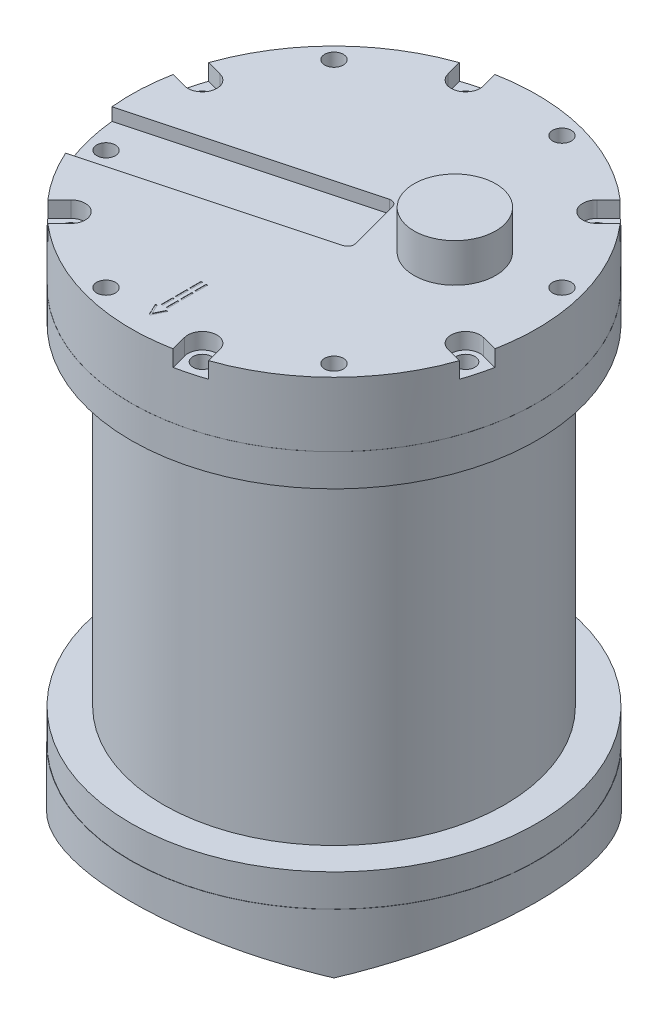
ISO-10303-21;
HEADER;
FILE_DESCRIPTION(('STEP AP214'),'2;1');
FILE_NAME('part.step','',(''),(''),'','','');
FILE_SCHEMA(('AUTOMOTIVE_DESIGN { 1 0 10303 214 1 1 1 1 }'));
ENDSEC;
DATA;
#1=APPLICATION_CONTEXT('core data for automotive mechanical design processes');
#2=APPLICATION_PROTOCOL_DEFINITION('international standard','automotive_design',2000,#1);
#3=PRODUCT_CONTEXT('',#1,'mechanical');
#4=PRODUCT('Part','Part','',(#3));
#5=PRODUCT_RELATED_PRODUCT_CATEGORY('part','',(#4));
#6=PRODUCT_DEFINITION_FORMATION('','',#4);
#7=PRODUCT_DEFINITION_CONTEXT('part definition',#1,'design');
#8=PRODUCT_DEFINITION('design','',#6,#7);
#9=PRODUCT_DEFINITION_SHAPE('','',#8);
#10=(LENGTH_UNIT() NAMED_UNIT(*) SI_UNIT(.MILLI.,.METRE.));
#11=(NAMED_UNIT(*) PLANE_ANGLE_UNIT() SI_UNIT($,.RADIAN.));
#12=(NAMED_UNIT(*) SI_UNIT($,.STERADIAN.) SOLID_ANGLE_UNIT());
#13=UNCERTAINTY_MEASURE_WITH_UNIT(LENGTH_MEASURE(1.E-05),#10,'distance_accuracy_value','');
#14=(GEOMETRIC_REPRESENTATION_CONTEXT(3) GLOBAL_UNCERTAINTY_ASSIGNED_CONTEXT((#13)) GLOBAL_UNIT_ASSIGNED_CONTEXT((#10,
#11,#12)) REPRESENTATION_CONTEXT('',''));
#15=CARTESIAN_POINT('',(0.,0.,0.));
#16=DIRECTION('',(0.,0.,1.));
#17=DIRECTION('',(1.,0.,0.));
#18=AXIS2_PLACEMENT_3D('',#15,#16,#17);
#19=CARTESIAN_POINT('',(0.,174.,0.));
#20=DIRECTION('',(0.,1.,0.));
#21=DIRECTION('',(0.,0.,1.));
#22=AXIS2_PLACEMENT_3D('',#19,#20,#21);
#23=PLANE('',#22);
#24=DIRECTION('',(-0.430632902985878,0.,-0.902527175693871));
#25=VECTOR('',#24,1.);
#26=CARTESIAN_POINT('',(-1.07359274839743,174.,56.2858274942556));
#27=LINE('',#26,#25);
#28=CARTESIAN_POINT('',(-1.07359274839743,174.,56.2858274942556));
#29=VERTEX_POINT('',#28);
#30=CARTESIAN_POINT('',(-2.82158119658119,174.,52.6223659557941));
#31=VERTEX_POINT('',#30);
#32=EDGE_CURVE('E574',#29,#31,#27,.T.);
#33=ORIENTED_EDGE('',*,*,#32,.T.);
#34=DIRECTION('',(1.,0.,0.));
#35=VECTOR('',#34,1.);
#36=CARTESIAN_POINT('',(-2.82158119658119,174.,52.6223659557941));
#37=LINE('',#36,#35);
#38=CARTESIAN_POINT('',(-2.3053468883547,174.,52.6223659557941));
#39=VERTEX_POINT('',#38);
#40=EDGE_CURVE('E65',#31,#39,#37,.T.);
#41=ORIENTED_EDGE('',*,*,#40,.T.);
#42=DIRECTION('',(0.430646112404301,0.,0.902520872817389));
#43=VECTOR('',#42,1.);
#44=CARTESIAN_POINT('',(-2.3053468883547,174.,52.6223659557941));
#45=LINE('',#44,#43);
#46=CARTESIAN_POINT('',(-0.888087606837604,174.,55.592568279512));
#47=VERTEX_POINT('',#46);
#48=EDGE_CURVE('E578',#39,#47,#45,.T.);
#49=ORIENTED_EDGE('',*,*,#48,.T.);
#50=DIRECTION('',(0.430646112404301,0.,-0.902520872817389));
#51=VECTOR('',#50,1.);
#52=CARTESIAN_POINT('',(-0.888087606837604,174.,55.592568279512));
#53=LINE('',#52,#51);
#54=CARTESIAN_POINT('',(0.52917167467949,174.,52.6223659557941));
#55=VERTEX_POINT('',#54);
#56=EDGE_CURVE('E2341',#47,#55,#53,.T.);
#57=ORIENTED_EDGE('',*,*,#56,.T.);
#58=DIRECTION('',(1.,0.,0.));
#59=VECTOR('',#58,1.);
#60=CARTESIAN_POINT('',(0.52917167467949,174.,52.6223659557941));
#61=LINE('',#60,#59);
#62=CARTESIAN_POINT('',(1.04540598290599,174.,52.6223659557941));
#63=VERTEX_POINT('',#62);
#64=EDGE_CURVE('E2345',#55,#63,#61,.T.);
#65=ORIENTED_EDGE('',*,*,#64,.T.);
#66=DIRECTION('',(-0.430632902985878,0.,0.902527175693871));
#67=VECTOR('',#66,1.);
#68=CARTESIAN_POINT('',(1.04540598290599,174.,52.6223659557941));
#69=LINE('',#68,#67);
#70=CARTESIAN_POINT('',(-0.702582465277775,174.,56.2858274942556));
#71=VERTEX_POINT('',#70);
#72=EDGE_CURVE('E2349',#63,#71,#69,.T.);
#73=ORIENTED_EDGE('',*,*,#72,.T.);
#74=DIRECTION('',(-1.,0.,0.));
#75=VECTOR('',#74,1.);
#76=CARTESIAN_POINT('',(-0.702582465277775,174.,56.2858274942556));
#77=LINE('',#76,#75);
#78=EDGE_CURVE('E2353',#71,#29,#77,.T.);
#79=ORIENTED_EDGE('',*,*,#78,.T.);
#80=EDGE_LOOP('',(#33,#41,#49,#57,#65,#73,#79));
#81=FACE_BOUND('',#80,.T.);
#82=DIRECTION('',(1.,0.,0.));
#83=VECTOR('',#82,1.);
#84=CARTESIAN_POINT('',(-0.311431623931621,174.,48.2126437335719));
#85=LINE('',#84,#83);
#86=CARTESIAN_POINT('',(-0.311431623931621,174.,48.2126437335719));
#87=VERTEX_POINT('',#86);
#88=CARTESIAN_POINT('',(0.163461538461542,174.,48.2126437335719));
#89=VERTEX_POINT('',#88);
#90=EDGE_CURVE('E633',#87,#89,#85,.T.);
#91=ORIENTED_EDGE('',*,*,#90,.T.);
#92=DIRECTION('',(0.,0.,1.));
#93=VECTOR('',#92,1.);
#94=CARTESIAN_POINT('',(0.163461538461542,174.,48.2126437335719));
#95=LINE('',#94,#93);
#96=CARTESIAN_POINT('',(0.163461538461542,174.,51.7404215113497));
#97=VERTEX_POINT('',#96);
#98=EDGE_CURVE('E627',#89,#97,#95,.T.);
#99=ORIENTED_EDGE('',*,*,#98,.T.);
#100=DIRECTION('',(-1.,0.,0.));
#101=VECTOR('',#100,1.);
#102=CARTESIAN_POINT('',(0.163461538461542,174.,51.7404215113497));
#103=LINE('',#102,#101);
#104=CARTESIAN_POINT('',(-0.311431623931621,174.,51.7404215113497));
#105=VERTEX_POINT('',#104);
#106=EDGE_CURVE('E646',#97,#105,#103,.T.);
#107=ORIENTED_EDGE('',*,*,#106,.T.);
#108=DIRECTION('',(0.,0.,-1.));
#109=VECTOR('',#108,1.);
#110=CARTESIAN_POINT('',(-0.311431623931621,174.,51.7404215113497));
#111=LINE('',#110,#109);
#112=EDGE_CURVE('E650',#105,#87,#111,.T.);
#113=ORIENTED_EDGE('',*,*,#112,.T.);
#114=EDGE_LOOP('',(#91,#99,#107,#113));
#115=FACE_BOUND('',#114,.T.);
#116=DIRECTION('',(1.,0.,0.));
#117=VECTOR('',#116,1.);
#118=CARTESIAN_POINT('',(-0.311431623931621,174.,43.8029215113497));
#119=LINE('',#118,#117);
#120=CARTESIAN_POINT('',(-0.311431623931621,174.,43.8029215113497));
#121=VERTEX_POINT('',#120);
#122=CARTESIAN_POINT('',(0.163461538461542,174.,43.8029215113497));
#123=VERTEX_POINT('',#122);
#124=EDGE_CURVE('E719',#121,#123,#119,.T.);
#125=ORIENTED_EDGE('',*,*,#124,.T.);
#126=DIRECTION('',(0.,0.,1.));
#127=VECTOR('',#126,1.);
#128=CARTESIAN_POINT('',(0.163461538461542,174.,43.8029215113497));
#129=LINE('',#128,#127);
#130=CARTESIAN_POINT('',(0.163461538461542,174.,47.3306992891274));
#131=VERTEX_POINT('',#130);
#132=EDGE_CURVE('E713',#123,#131,#129,.T.);
#133=ORIENTED_EDGE('',*,*,#132,.T.);
#134=DIRECTION('',(-1.,0.,0.));
#135=VECTOR('',#134,1.);
#136=CARTESIAN_POINT('',(0.163461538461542,174.,47.3306992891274));
#137=LINE('',#136,#135);
#138=CARTESIAN_POINT('',(-0.311431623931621,174.,47.3306992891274));
#139=VERTEX_POINT('',#138);
#140=EDGE_CURVE('E732',#131,#139,#137,.T.);
#141=ORIENTED_EDGE('',*,*,#140,.T.);
#142=DIRECTION('',(0.,0.,-1.));
#143=VECTOR('',#142,1.);
#144=CARTESIAN_POINT('',(-0.311431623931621,174.,47.3306992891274));
#145=LINE('',#144,#143);
#146=EDGE_CURVE('E736',#139,#121,#145,.T.);
#147=ORIENTED_EDGE('',*,*,#146,.T.);
#148=EDGE_LOOP('',(#125,#133,#141,#147));
#149=FACE_BOUND('',#148,.T.);
#150=DIRECTION('',(1.,0.,0.));
#151=VECTOR('',#150,1.);
#152=CARTESIAN_POINT('',(-0.311431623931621,174.,39.3931992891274));
#153=LINE('',#152,#151);
#154=CARTESIAN_POINT('',(-0.311431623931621,174.,39.3931992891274));
#155=VERTEX_POINT('',#154);
#156=CARTESIAN_POINT('',(0.163461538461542,174.,39.3931992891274));
#157=VERTEX_POINT('',#156);
#158=EDGE_CURVE('E804',#155,#157,#153,.T.);
#159=ORIENTED_EDGE('',*,*,#158,.T.);
#160=DIRECTION('',(0.,0.,1.));
#161=VECTOR('',#160,1.);
#162=CARTESIAN_POINT('',(0.163461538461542,174.,39.3931992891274));
#163=LINE('',#162,#161);
#164=CARTESIAN_POINT('',(0.163461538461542,174.,42.9209770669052));
#165=VERTEX_POINT('',#164);
#166=EDGE_CURVE('E798',#157,#165,#163,.T.);
#167=ORIENTED_EDGE('',*,*,#166,.T.);
#168=DIRECTION('',(-1.,0.,0.));
#169=VECTOR('',#168,1.);
#170=CARTESIAN_POINT('',(0.163461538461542,174.,42.9209770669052));
#171=LINE('',#170,#169);
#172=CARTESIAN_POINT('',(-0.311431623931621,174.,42.9209770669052));
#173=VERTEX_POINT('',#172);
#174=EDGE_CURVE('E817',#165,#173,#171,.T.);
#175=ORIENTED_EDGE('',*,*,#174,.T.);
#176=DIRECTION('',(0.,0.,-1.));
#177=VECTOR('',#176,1.);
#178=CARTESIAN_POINT('',(-0.311431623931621,174.,42.9209770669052));
#179=LINE('',#178,#177);
#180=EDGE_CURVE('E821',#173,#155,#179,.T.);
#181=ORIENTED_EDGE('',*,*,#180,.T.);
#182=EDGE_LOOP('',(#159,#167,#175,#181));
#183=FACE_BOUND('',#182,.T.);
#184=DIRECTION('',(-0.965925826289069,0.,0.258819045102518));
#185=VECTOR('',#184,1.);
#186=CARTESIAN_POINT('',(5.25235324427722,174.,-11.9257698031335));
#187=LINE('',#186,#185);
#188=CARTESIAN_POINT('',(5.25235324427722,174.,-11.9257698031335));
#189=VERTEX_POINT('',#188);
#190=CARTESIAN_POINT('',(-62.6863797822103,174.,6.27835884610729));
#191=VERTEX_POINT('',#190);
#192=EDGE_CURVE('E846',#189,#191,#187,.T.);
#193=ORIENTED_EDGE('',*,*,#192,.F.);
#194=CARTESIAN_POINT('',(5.76999133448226,174.,-9.99391815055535));
#195=DIRECTION('',(0.,1.,0.));
#196=DIRECTION('',(0.,0.,-1.));
#197=AXIS2_PLACEMENT_3D('',#194,#195,#196);
#198=CIRCLE('',#197,2.);
#199=CARTESIAN_POINT('',(7.7018429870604,174.,-10.5115562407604));
#200=VERTEX_POINT('',#199);
#201=EDGE_CURVE('E870',#200,#189,#198,.T.);
#202=ORIENTED_EDGE('',*,*,#201,.F.);
#203=DIRECTION('',(-0.258819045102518,0.,-0.965925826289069));
#204=VECTOR('',#203,1.);
#205=CARTESIAN_POINT('',(11.9257698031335,174.,5.25235324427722));
#206=LINE('',#205,#204);
#207=CARTESIAN_POINT('',(11.9257698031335,174.,5.25235324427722));
#208=VERTEX_POINT('',#207);
#209=EDGE_CURVE('E866',#208,#200,#206,.T.);
#210=ORIENTED_EDGE('',*,*,#209,.F.);
#211=CARTESIAN_POINT('',(9.99391815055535,174.,5.76999133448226));
#212=DIRECTION('',(0.,1.,0.));
#213=DIRECTION('',(0.,0.,1.));
#214=AXIS2_PLACEMENT_3D('',#211,#212,#213);
#215=CIRCLE('',#214,2.);
#216=CARTESIAN_POINT('',(10.5115562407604,174.,7.7018429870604));
#217=VERTEX_POINT('',#216);
#218=EDGE_CURVE('E863',#217,#208,#215,.T.);
#219=ORIENTED_EDGE('',*,*,#218,.F.);
#220=DIRECTION('',(0.965925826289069,0.,-0.258819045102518));
#221=VECTOR('',#220,1.);
#222=CARTESIAN_POINT('',(10.5115562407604,174.,7.7018429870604));
#223=LINE('',#222,#221);
#224=CARTESIAN_POINT('',(-57.4271767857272,174.,25.9059716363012));
#225=VERTEX_POINT('',#224);
#226=EDGE_CURVE('E841',#225,#217,#223,.T.);
#227=ORIENTED_EDGE('',*,*,#226,.F.);
#228=CARTESIAN_POINT('',(0.,174.,0.));
#229=DIRECTION('',(0.,1.,0.));
#230=DIRECTION('',(0.,0.,1.));
#231=AXIS2_PLACEMENT_3D('',#228,#229,#230);
#232=CIRCLE('',#231,63.);
#233=CARTESIAN_POINT('',(-47.615920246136,174.,41.2519592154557));
#234=VERTEX_POINT('',#233);
#235=EDGE_CURVE('E1185',#225,#234,#232,.T.);
#236=ORIENTED_EDGE('',*,*,#235,.T.);
#237=DIRECTION('',(-0.707106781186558,0.,0.707106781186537));
#238=VECTOR('',#237,1.);
#239=CARTESIAN_POINT('',(-44.0527524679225,174.,37.6887914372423));
#240=LINE('',#239,#238);
#241=CARTESIAN_POINT('',(-44.0527524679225,174.,37.6887914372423));
#242=VERTEX_POINT('',#241);
#243=EDGE_CURVE('E899',#242,#234,#240,.T.);
#244=ORIENTED_EDGE('',*,*,#243,.F.);
#245=CARTESIAN_POINT('',(-40.8707719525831,174.,40.8707719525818));
#246=DIRECTION('',(0.,1.,0.));
#247=DIRECTION('',(0.866025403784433,0.,0.50000000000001));
#248=AXIS2_PLACEMENT_3D('',#245,#246,#247);
#249=CIRCLE('',#248,4.5);
#250=CARTESIAN_POINT('',(-37.6887914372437,174.,44.0527524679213));
#251=VERTEX_POINT('',#250);
#252=EDGE_CURVE('E910',#251,#242,#249,.T.);
#253=ORIENTED_EDGE('',*,*,#252,.F.);
#254=DIRECTION('',(0.707106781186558,0.,-0.707106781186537));
#255=VECTOR('',#254,1.);
#256=CARTESIAN_POINT('',(-37.6887914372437,174.,44.0527524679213));
#257=LINE('',#256,#255);
#258=CARTESIAN_POINT('',(-41.2519592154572,174.,47.6159202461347));
#259=VERTEX_POINT('',#258);
#260=EDGE_CURVE('E894',#259,#251,#257,.T.);
#261=ORIENTED_EDGE('',*,*,#260,.F.);
#262=CARTESIAN_POINT('',(11.9172845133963,174.,61.8625761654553));
#263=VERTEX_POINT('',#262);
#264=EDGE_CURVE('E2382',#259,#263,#232,.T.);
#265=ORIENTED_EDGE('',*,*,#264,.T.);
#266=DIRECTION('',(0.258819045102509,0.,0.965925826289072));
#267=VECTOR('',#266,1.);
#268=CARTESIAN_POINT('',(10.6130745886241,174.,56.9951984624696));
#269=LINE('',#268,#267);
#270=CARTESIAN_POINT('',(10.6130745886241,174.,56.9951984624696));
#271=VERTEX_POINT('',#270);
#272=EDGE_CURVE('E940',#271,#263,#269,.T.);
#273=ORIENTED_EDGE('',*,*,#272,.F.);
#274=CARTESIAN_POINT('',(14.959740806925,174.,55.8305127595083));
#275=DIRECTION('',(0.,1.,0.));
#276=DIRECTION('',(0.866025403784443,0.,-0.499999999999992));
#277=AXIS2_PLACEMENT_3D('',#274,#275,#276);
#278=CIRCLE('',#277,4.5);
#279=CARTESIAN_POINT('',(19.3064070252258,174.,54.6658270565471));
#280=VERTEX_POINT('',#279);
#281=EDGE_CURVE('E951',#280,#271,#278,.T.);
#282=ORIENTED_EDGE('',*,*,#281,.F.);
#283=DIRECTION('',(-0.258819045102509,0.,-0.965925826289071));
#284=VECTOR('',#283,1.);
#285=CARTESIAN_POINT('',(19.3064070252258,174.,54.6658270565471));
#286=LINE('',#285,#284);
#287=CARTESIAN_POINT('',(20.610616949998,174.,59.5332047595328));
#288=VERTEX_POINT('',#287);
#289=EDGE_CURVE('E935',#288,#280,#286,.T.);
#290=ORIENTED_EDGE('',*,*,#289,.F.);
#291=CARTESIAN_POINT('',(59.5332047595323,174.,20.6106169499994));
#292=VERTEX_POINT('',#291);
#293=EDGE_CURVE('E2383',#288,#292,#232,.T.);
#294=ORIENTED_EDGE('',*,*,#293,.T.);
#295=DIRECTION('',(0.965925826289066,0.,0.258819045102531));
#296=VECTOR('',#295,1.);
#297=CARTESIAN_POINT('',(54.6658270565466,174.,19.3064070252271));
#298=LINE('',#297,#296);
#299=CARTESIAN_POINT('',(54.6658270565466,174.,19.3064070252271));
#300=VERTEX_POINT('',#299);
#301=EDGE_CURVE('E981',#300,#292,#298,.T.);
#302=ORIENTED_EDGE('',*,*,#301,.F.);
#303=CARTESIAN_POINT('',(55.830512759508,174.,14.9597408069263));
#304=DIRECTION('',(0.,1.,0.));
#305=DIRECTION('',(0.,0.,-1.));
#306=AXIS2_PLACEMENT_3D('',#303,#304,#305);
#307=CIRCLE('',#306,4.5);
#308=CARTESIAN_POINT('',(56.9951984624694,174.,10.6130745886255));
#309=VERTEX_POINT('',#308);
#310=EDGE_CURVE('E992',#309,#300,#307,.T.);
#311=ORIENTED_EDGE('',*,*,#310,.F.);
#312=DIRECTION('',(-0.965925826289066,0.,-0.25881904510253));
#313=VECTOR('',#312,1.);
#314=CARTESIAN_POINT('',(56.9951984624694,174.,10.6130745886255));
#315=LINE('',#314,#313);
#316=CARTESIAN_POINT('',(61.8625761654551,174.,11.9172845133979));
#317=VERTEX_POINT('',#316);
#318=EDGE_CURVE('E976',#317,#309,#315,.T.);
#319=ORIENTED_EDGE('',*,*,#318,.F.);
#320=CARTESIAN_POINT('',(47.6159202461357,174.,-41.251959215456));
#321=VERTEX_POINT('',#320);
#322=EDGE_CURVE('E2385',#317,#321,#232,.T.);
#323=ORIENTED_EDGE('',*,*,#322,.T.);
#324=DIRECTION('',(0.707106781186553,0.,-0.707106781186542));
#325=VECTOR('',#324,1.);
#326=CARTESIAN_POINT('',(44.0527524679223,174.,-37.6887914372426));
#327=LINE('',#326,#325);
#328=CARTESIAN_POINT('',(44.0527524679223,174.,-37.6887914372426));
#329=VERTEX_POINT('',#328);
#330=EDGE_CURVE('E1021',#329,#321,#327,.T.);
#331=ORIENTED_EDGE('',*,*,#330,.F.);
#332=CARTESIAN_POINT('',(40.8707719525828,174.,-40.8707719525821));
#333=DIRECTION('',(0.,1.,0.));
#334=DIRECTION('',(-0.866025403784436,0.,-0.500000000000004));
#335=AXIS2_PLACEMENT_3D('',#332,#333,#334);
#336=CIRCLE('',#335,4.5);
#337=CARTESIAN_POINT('',(37.6887914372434,174.,-44.0527524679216));
#338=VERTEX_POINT('',#337);
#339=EDGE_CURVE('E1029',#338,#329,#336,.T.);
#340=ORIENTED_EDGE('',*,*,#339,.F.);
#341=DIRECTION('',(-0.707106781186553,0.,0.707106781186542));
#342=VECTOR('',#341,1.);
#343=CARTESIAN_POINT('',(37.6887914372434,174.,-44.0527524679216));
#344=LINE('',#343,#342);
#345=CARTESIAN_POINT('',(41.2519592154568,174.,-47.615920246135));
#346=VERTEX_POINT('',#345);
#347=EDGE_CURVE('E1017',#346,#338,#344,.T.);
#348=ORIENTED_EDGE('',*,*,#347,.F.);
#349=CARTESIAN_POINT('',(-11.9172845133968,174.,-61.8625761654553));
#350=VERTEX_POINT('',#349);
#351=EDGE_CURVE('E2387',#346,#350,#232,.T.);
#352=ORIENTED_EDGE('',*,*,#351,.T.);
#353=DIRECTION('',(-0.258819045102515,0.,-0.96592582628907));
#354=VECTOR('',#353,1.);
#355=CARTESIAN_POINT('',(-10.6130745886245,174.,-56.9951984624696));
#356=LINE('',#355,#354);
#357=CARTESIAN_POINT('',(-10.6130745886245,174.,-56.9951984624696));
#358=VERTEX_POINT('',#357);
#359=EDGE_CURVE('E1051',#358,#350,#356,.T.);
#360=ORIENTED_EDGE('',*,*,#359,.F.);
#361=CARTESIAN_POINT('',(-14.9597408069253,174.,-55.8305127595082));
#362=DIRECTION('',(0.,1.,0.));
#363=DIRECTION('',(-0.86602540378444,0.,0.499999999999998));
#364=AXIS2_PLACEMENT_3D('',#361,#362,#363);
#365=CIRCLE('',#364,4.5);
#366=CARTESIAN_POINT('',(-19.3064070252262,174.,-54.6658270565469));
#367=VERTEX_POINT('',#366);
#368=EDGE_CURVE('E1059',#367,#358,#365,.T.);
#369=ORIENTED_EDGE('',*,*,#368,.F.);
#370=DIRECTION('',(0.258819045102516,0.,0.96592582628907));
#371=VECTOR('',#370,1.);
#372=CARTESIAN_POINT('',(-19.3064070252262,174.,-54.6658270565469));
#373=LINE('',#372,#371);
#374=CARTESIAN_POINT('',(-20.6106169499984,174.,-59.5332047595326));
#375=VERTEX_POINT('',#374);
#376=EDGE_CURVE('E1047',#375,#367,#373,.T.);
#377=ORIENTED_EDGE('',*,*,#376,.F.);
#378=CARTESIAN_POINT('',(-59.5332047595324,174.,-20.610616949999));
#379=VERTEX_POINT('',#378);
#380=EDGE_CURVE('E1186',#375,#379,#232,.T.);
#381=ORIENTED_EDGE('',*,*,#380,.T.);
#382=DIRECTION('',(-0.965925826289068,0.,-0.258819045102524));
#383=VECTOR('',#382,1.);
#384=CARTESIAN_POINT('',(-54.6658270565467,174.,-19.3064070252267));
#385=LINE('',#384,#383);
#386=CARTESIAN_POINT('',(-54.6658270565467,174.,-19.3064070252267));
#387=VERTEX_POINT('',#386);
#388=EDGE_CURVE('E1082',#387,#379,#385,.T.);
#389=ORIENTED_EDGE('',*,*,#388,.F.);
#390=CARTESIAN_POINT('',(-55.8305127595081,174.,-14.9597408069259));
#391=DIRECTION('',(0.,1.,0.));
#392=DIRECTION('',(0.,0.,1.));
#393=AXIS2_PLACEMENT_3D('',#390,#391,#392);
#394=CIRCLE('',#393,4.5);
#395=CARTESIAN_POINT('',(-56.9951984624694,174.,-10.6130745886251));
#396=VERTEX_POINT('',#395);
#397=EDGE_CURVE('E1093',#396,#387,#394,.T.);
#398=ORIENTED_EDGE('',*,*,#397,.F.);
#399=DIRECTION('',(0.965925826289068,0.,0.258819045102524));
#400=VECTOR('',#399,1.);
#401=CARTESIAN_POINT('',(-56.9951984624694,174.,-10.6130745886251));
#402=LINE('',#401,#400);
#403=CARTESIAN_POINT('',(-61.8625761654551,174.,-11.9172845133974));
#404=VERTEX_POINT('',#403);
#405=EDGE_CURVE('E1077',#404,#396,#402,.T.);
#406=ORIENTED_EDGE('',*,*,#405,.F.);
#407=EDGE_CURVE('E1180',#404,#191,#232,.T.);
#408=ORIENTED_EDGE('',*,*,#407,.T.);
#409=EDGE_LOOP('',(#193,#202,#210,#219,#227,#236,#244,#253,#261,#265,#273,#282,#290,#294,#302,
#311,#319,#323,#331,#340,#348,#352,#360,#369,#377,#381,#389,#398,#406,#408));
#410=FACE_BOUND('',#409,.T.);
#411=CARTESIAN_POINT('',(-14.9597408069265,174.,55.8305127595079));
#412=DIRECTION('',(0.,1.,0.));
#413=DIRECTION('',(0.866025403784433,0.,0.50000000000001));
#414=AXIS2_PLACEMENT_3D('',#411,#412,#413);
#415=CIRCLE('',#414,2.89999999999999);
#416=CARTESIAN_POINT('',(-12.4482671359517,174.,57.280512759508));
#417=VERTEX_POINT('',#416);
#418=EDGE_CURVE('E1126',#417,#417,#415,.T.);
#419=ORIENTED_EDGE('',*,*,#418,.F.);
#420=EDGE_LOOP('',(#419));
#421=FACE_BOUND('',#420,.T.);
#422=CARTESIAN_POINT('',(40.870771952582,174.,40.8707719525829));
#423=DIRECTION('',(0.,1.,0.));
#424=DIRECTION('',(0.866025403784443,0.,-0.499999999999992));
#425=AXIS2_PLACEMENT_3D('',#422,#423,#424);
#426=CIRCLE('',#425,2.89999999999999);
#427=CARTESIAN_POINT('',(43.3822456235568,174.,39.420771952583));
#428=VERTEX_POINT('',#427);
#429=EDGE_CURVE('E1138',#428,#428,#426,.T.);
#430=ORIENTED_EDGE('',*,*,#429,.F.);
#431=EDGE_LOOP('',(#430));
#432=FACE_BOUND('',#431,.T.);
#433=CARTESIAN_POINT('',(55.8305127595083,174.,-14.9597408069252));
#434=DIRECTION('',(0.,1.,0.));
#435=DIRECTION('',(0.,0.,-1.));
#436=AXIS2_PLACEMENT_3D('',#433,#434,#435);
#437=CIRCLE('',#436,2.89999999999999);
#438=CARTESIAN_POINT('',(55.8305127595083,174.,-17.8597408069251));
#439=VERTEX_POINT('',#438);
#440=EDGE_CURVE('E1149',#439,#439,#437,.T.);
#441=ORIENTED_EDGE('',*,*,#440,.F.);
#442=EDGE_LOOP('',(#441));
#443=FACE_BOUND('',#442,.T.);
#444=CARTESIAN_POINT('',(14.9597408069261,174.,-55.830512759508));
#445=DIRECTION('',(0.,1.,0.));
#446=DIRECTION('',(-0.866025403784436,0.,-0.500000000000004));
#447=AXIS2_PLACEMENT_3D('',#444,#445,#446);
#448=CIRCLE('',#447,2.89999999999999);
#449=CARTESIAN_POINT('',(12.4482671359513,174.,-57.280512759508));
#450=VERTEX_POINT('',#449);
#451=EDGE_CURVE('E1159',#450,#450,#448,.T.);
#452=ORIENTED_EDGE('',*,*,#451,.F.);
#453=EDGE_LOOP('',(#452));
#454=FACE_BOUND('',#453,.T.);
#455=CARTESIAN_POINT('',(-40.8707719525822,174.,-40.8707719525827));
#456=DIRECTION('',(0.,1.,0.));
#457=DIRECTION('',(-0.86602540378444,0.,0.499999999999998));
#458=AXIS2_PLACEMENT_3D('',#455,#456,#457);
#459=CIRCLE('',#458,2.89999999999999);
#460=CARTESIAN_POINT('',(-43.3822456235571,174.,-39.4207719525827));
#461=VERTEX_POINT('',#460);
#462=EDGE_CURVE('E1169',#461,#461,#459,.T.);
#463=ORIENTED_EDGE('',*,*,#462,.F.);
#464=EDGE_LOOP('',(#463));
#465=FACE_BOUND('',#464,.T.);
#466=DIRECTION('',(1.,0.,0.));
#467=VECTOR('',#466,1.);
#468=CARTESIAN_POINT('',(-1.87179487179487,174.,39.3931992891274));
#469=LINE('',#468,#467);
#470=CARTESIAN_POINT('',(-1.87179487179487,174.,39.3931992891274));
#471=VERTEX_POINT('',#470);
#472=CARTESIAN_POINT('',(-1.39690170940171,174.,39.3931992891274));
#473=VERTEX_POINT('',#472);
#474=EDGE_CURVE('E761',#471,#473,#469,.T.);
#475=ORIENTED_EDGE('',*,*,#474,.T.);
#476=DIRECTION('',(0.,0.,1.));
#477=VECTOR('',#476,1.);
#478=CARTESIAN_POINT('',(-1.39690170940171,174.,39.3931992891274));
#479=LINE('',#478,#477);
#480=CARTESIAN_POINT('',(-1.39690170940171,174.,42.9209770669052));
#481=VERTEX_POINT('',#480);
#482=EDGE_CURVE('E755',#473,#481,#479,.T.);
#483=ORIENTED_EDGE('',*,*,#482,.T.);
#484=DIRECTION('',(-1.,0.,0.));
#485=VECTOR('',#484,1.);
#486=CARTESIAN_POINT('',(-1.39690170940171,174.,42.9209770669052));
#487=LINE('',#486,#485);
#488=CARTESIAN_POINT('',(-1.87179487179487,174.,42.9209770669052));
#489=VERTEX_POINT('',#488);
#490=EDGE_CURVE('E774',#481,#489,#487,.T.);
#491=ORIENTED_EDGE('',*,*,#490,.T.);
#492=DIRECTION('',(0.,0.,-1.));
#493=VECTOR('',#492,1.);
#494=CARTESIAN_POINT('',(-1.87179487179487,174.,42.9209770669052));
#495=LINE('',#494,#493);
#496=EDGE_CURVE('E778',#489,#471,#495,.T.);
#497=ORIENTED_EDGE('',*,*,#496,.T.);
#498=EDGE_LOOP('',(#475,#483,#491,#497));
#499=FACE_BOUND('',#498,.T.);
#500=DIRECTION('',(1.,0.,0.));
#501=VECTOR('',#500,1.);
#502=CARTESIAN_POINT('',(-1.87179487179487,174.,43.8029215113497));
#503=LINE('',#502,#501);
#504=CARTESIAN_POINT('',(-1.87179487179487,174.,43.8029215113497));
#505=VERTEX_POINT('',#504);
#506=CARTESIAN_POINT('',(-1.39690170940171,174.,43.8029215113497));
#507=VERTEX_POINT('',#506);
#508=EDGE_CURVE('E676',#505,#507,#503,.T.);
#509=ORIENTED_EDGE('',*,*,#508,.T.);
#510=DIRECTION('',(0.,0.,1.));
#511=VECTOR('',#510,1.);
#512=CARTESIAN_POINT('',(-1.39690170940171,174.,43.8029215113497));
#513=LINE('',#512,#511);
#514=CARTESIAN_POINT('',(-1.39690170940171,174.,47.3306992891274));
#515=VERTEX_POINT('',#514);
#516=EDGE_CURVE('E670',#507,#515,#513,.T.);
#517=ORIENTED_EDGE('',*,*,#516,.T.);
#518=DIRECTION('',(-1.,0.,0.));
#519=VECTOR('',#518,1.);
#520=CARTESIAN_POINT('',(-1.39690170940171,174.,47.3306992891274));
#521=LINE('',#520,#519);
#522=CARTESIAN_POINT('',(-1.87179487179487,174.,47.3306992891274));
#523=VERTEX_POINT('',#522);
#524=EDGE_CURVE('E689',#515,#523,#521,.T.);
#525=ORIENTED_EDGE('',*,*,#524,.T.);
#526=DIRECTION('',(0.,0.,-1.));
#527=VECTOR('',#526,1.);
#528=CARTESIAN_POINT('',(-1.87179487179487,174.,47.3306992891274));
#529=LINE('',#528,#527);
#530=EDGE_CURVE('E693',#523,#505,#529,.T.);
#531=ORIENTED_EDGE('',*,*,#530,.T.);
#532=EDGE_LOOP('',(#509,#517,#525,#531));
#533=FACE_BOUND('',#532,.T.);
#534=DIRECTION('',(1.,0.,0.));
#535=VECTOR('',#534,1.);
#536=CARTESIAN_POINT('',(-1.87179487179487,174.,48.2126437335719));
#537=LINE('',#536,#535);
#538=CARTESIAN_POINT('',(-1.87179487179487,174.,48.2126437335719));
#539=VERTEX_POINT('',#538);
#540=CARTESIAN_POINT('',(-1.39690170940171,174.,48.2126437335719));
#541=VERTEX_POINT('',#540);
#542=EDGE_CURVE('E596',#539,#541,#537,.T.);
#543=ORIENTED_EDGE('',*,*,#542,.T.);
#544=DIRECTION('',(0.,0.,1.));
#545=VECTOR('',#544,1.);
#546=CARTESIAN_POINT('',(-1.39690170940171,174.,48.2126437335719));
#547=LINE('',#546,#545);
#548=CARTESIAN_POINT('',(-1.39690170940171,174.,51.7404215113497));
#549=VERTEX_POINT('',#548);
#550=EDGE_CURVE('E76',#541,#549,#547,.T.);
#551=ORIENTED_EDGE('',*,*,#550,.T.);
#552=DIRECTION('',(-1.,0.,0.));
#553=VECTOR('',#552,1.);
#554=CARTESIAN_POINT('',(-1.39690170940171,174.,51.7404215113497));
#555=LINE('',#554,#553);
#556=CARTESIAN_POINT('',(-1.87179487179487,174.,51.7404215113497));
#557=VERTEX_POINT('',#556);
#558=EDGE_CURVE('E584',#549,#557,#555,.T.);
#559=ORIENTED_EDGE('',*,*,#558,.T.);
#560=DIRECTION('',(0.,0.,-1.));
#561=VECTOR('',#560,1.);
#562=CARTESIAN_POINT('',(-1.87179487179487,174.,51.7404215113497));
#563=LINE('',#562,#561);
#564=EDGE_CURVE('E609',#557,#539,#563,.T.);
#565=ORIENTED_EDGE('',*,*,#564,.T.);
#566=EDGE_LOOP('',(#543,#551,#559,#565));
#567=FACE_BOUND('',#566,.T.);
#568=CARTESIAN_POINT('',(29.59896089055,174.,-7.93101766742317));
#569=DIRECTION('',(0.,1.,0.));
#570=DIRECTION('',(0.,0.,1.));
#571=AXIS2_PLACEMENT_3D('',#568,#569,#570);
#572=CIRCLE('',#571,12.6827132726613);
#573=CARTESIAN_POINT('',(29.59896089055,174.,4.75169560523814));
#574=VERTEX_POINT('',#573);
#575=EDGE_CURVE('E2317',#574,#574,#572,.T.);
#576=ORIENTED_EDGE('',*,*,#575,.F.);
#577=EDGE_LOOP('',(#576));
#578=FACE_BOUND('',#577,.T.);
#579=ADVANCED_FACE('F44',(#81,#115,#149,#183,#410,#421,#432,#443,#454,#465,#499,#533,#567,#578),
#23,.T.);
#580=CARTESIAN_POINT('',(-55.8305127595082,174.,14.9597408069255));
#581=DIRECTION('',(0.,1.,0.));
#582=DIRECTION('',(0.,0.,1.));
#583=AXIS2_PLACEMENT_3D('',#580,#581,#582);
#584=CYLINDRICAL_SURFACE('',#583,2.89999999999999);
#585=CARTESIAN_POINT('',(-55.8305127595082,144.,14.9597408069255));
#586=DIRECTION('',(0.,1.,0.));
#587=DIRECTION('',(0.,0.,1.));
#588=AXIS2_PLACEMENT_3D('',#585,#586,#587);
#589=CIRCLE('',#588,2.89999999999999);
#590=CARTESIAN_POINT('',(-55.8305127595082,144.,17.8597408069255));
#591=VERTEX_POINT('',#590);
#592=EDGE_CURVE('E1176',#591,#591,#589,.T.);
#593=ORIENTED_EDGE('',*,*,#592,.F.);
#594=EDGE_LOOP('',(#593));
#595=FACE_BOUND('',#594,.T.);
#596=CARTESIAN_POINT('',(-55.8305127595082,170.06,14.9597408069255));
#597=DIRECTION('',(0.,1.,0.));
#598=DIRECTION('',(0.,0.,1.));
#599=AXIS2_PLACEMENT_3D('',#596,#597,#598);
#600=CIRCLE('',#599,2.89999999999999);
#601=CARTESIAN_POINT('',(-55.8305127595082,170.06,17.8597408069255));
#602=VERTEX_POINT('',#601);
#603=EDGE_CURVE('E48',#602,#602,#600,.F.);
#604=ORIENTED_EDGE('',*,*,#603,.F.);
#605=EDGE_LOOP('',(#604));
#606=FACE_BOUND('',#605,.T.);
#607=ADVANCED_FACE('F1289',(#595,#606),#584,.F.);
#608=CARTESIAN_POINT('',(-40.8707719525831,174.,40.8707719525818));
#609=DIRECTION('',(0.,1.,0.));
#610=DIRECTION('',(0.499999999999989,0.,0.866025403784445));
#611=AXIS2_PLACEMENT_3D('',#608,#609,#610);
#612=CYLINDRICAL_SURFACE('',#611,2.89999999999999);
#613=CARTESIAN_POINT('',(-40.8707719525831,144.,40.8707719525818));
#614=DIRECTION('',(0.,1.,0.));
#615=DIRECTION('',(0.499999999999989,0.,0.866025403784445));
#616=AXIS2_PLACEMENT_3D('',#613,#614,#615);
#617=CIRCLE('',#616,2.89999999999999);
#618=CARTESIAN_POINT('',(-39.4207719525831,144.,43.3822456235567));
#619=VERTEX_POINT('',#618);
#620=EDGE_CURVE('E1118',#619,#619,#617,.T.);
#621=ORIENTED_EDGE('',*,*,#620,.F.);
#622=EDGE_LOOP('',(#621));
#623=FACE_BOUND('',#622,.T.);
#624=CARTESIAN_POINT('',(-40.8707719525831,169.,40.8707719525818));
#625=DIRECTION('',(0.,1.,0.));
#626=DIRECTION('',(0.,0.,1.));
#627=AXIS2_PLACEMENT_3D('',#624,#625,#626);
#628=CIRCLE('',#627,2.89999999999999);
#629=CARTESIAN_POINT('',(-40.8707719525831,169.,43.7707719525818));
#630=VERTEX_POINT('',#629);
#631=EDGE_CURVE('E920',#630,#630,#628,.F.);
#632=ORIENTED_EDGE('',*,*,#631,.F.);
#633=EDGE_LOOP('',(#632));
#634=FACE_BOUND('',#633,.T.);
#635=ADVANCED_FACE('F1286',(#623,#634),#612,.F.);
#636=CARTESIAN_POINT('',(14.959740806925,174.,55.8305127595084));
#637=DIRECTION('',(0.,1.,0.));
#638=DIRECTION('',(1.,0.,0.));
#639=AXIS2_PLACEMENT_3D('',#636,#637,#638);
#640=CYLINDRICAL_SURFACE('',#639,2.89999999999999);
#641=CARTESIAN_POINT('',(14.959740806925,144.,55.8305127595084));
#642=DIRECTION('',(0.,1.,0.));
#643=DIRECTION('',(1.,0.,0.));
#644=AXIS2_PLACEMENT_3D('',#641,#642,#643);
#645=CIRCLE('',#644,2.89999999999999);
#646=CARTESIAN_POINT('',(17.8597408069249,144.,55.8305127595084));
#647=VERTEX_POINT('',#646);
#648=EDGE_CURVE('E1130',#647,#647,#645,.T.);
#649=ORIENTED_EDGE('',*,*,#648,.F.);
#650=EDGE_LOOP('',(#649));
#651=FACE_BOUND('',#650,.T.);
#652=CARTESIAN_POINT('',(14.959740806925,169.,55.8305127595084));
#653=DIRECTION('',(0.,1.,0.));
#654=DIRECTION('',(0.,0.,1.));
#655=AXIS2_PLACEMENT_3D('',#652,#653,#654);
#656=CIRCLE('',#655,2.89999999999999);
#657=CARTESIAN_POINT('',(14.959740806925,169.,58.7305127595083));
#658=VERTEX_POINT('',#657);
#659=EDGE_CURVE('E961',#658,#658,#656,.F.);
#660=ORIENTED_EDGE('',*,*,#659,.F.);
#661=EDGE_LOOP('',(#660));
#662=FACE_BOUND('',#661,.T.);
#663=ADVANCED_FACE('F1288',(#651,#662),#640,.F.);
#664=CARTESIAN_POINT('',(55.830512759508,174.,14.9597408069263));
#665=DIRECTION('',(0.,1.,0.));
#666=DIRECTION('',(0.500000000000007,0.,-0.866025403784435));
#667=AXIS2_PLACEMENT_3D('',#664,#665,#666);
#668=CYLINDRICAL_SURFACE('',#667,2.89999999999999);
#669=CARTESIAN_POINT('',(55.830512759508,144.,14.9597408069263));
#670=DIRECTION('',(0.,1.,0.));
#671=DIRECTION('',(0.500000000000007,0.,-0.866025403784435));
#672=AXIS2_PLACEMENT_3D('',#669,#670,#671);
#673=CIRCLE('',#672,2.89999999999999);
#674=CARTESIAN_POINT('',(57.280512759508,144.,12.4482671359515));
#675=VERTEX_POINT('',#674);
#676=EDGE_CURVE('E1142',#675,#675,#673,.T.);
#677=ORIENTED_EDGE('',*,*,#676,.F.);
#678=EDGE_LOOP('',(#677));
#679=FACE_BOUND('',#678,.T.);
#680=CARTESIAN_POINT('',(55.830512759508,169.,14.9597408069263));
#681=DIRECTION('',(0.,1.,0.));
#682=DIRECTION('',(0.,0.,1.));
#683=AXIS2_PLACEMENT_3D('',#680,#681,#682);
#684=CIRCLE('',#683,2.89999999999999);
#685=CARTESIAN_POINT('',(55.830512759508,169.,17.8597408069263));
#686=VERTEX_POINT('',#685);
#687=EDGE_CURVE('E1002',#686,#686,#684,.F.);
#688=ORIENTED_EDGE('',*,*,#687,.F.);
#689=EDGE_LOOP('',(#688));
#690=FACE_BOUND('',#689,.T.);
#691=ADVANCED_FACE('F1296',(#679,#690),#668,.F.);
#692=CARTESIAN_POINT('',(40.8707719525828,174.,-40.8707719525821));
#693=DIRECTION('',(0.,1.,0.));
#694=DIRECTION('',(-0.499999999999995,0.,-0.866025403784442));
#695=AXIS2_PLACEMENT_3D('',#692,#693,#694);
#696=CYLINDRICAL_SURFACE('',#695,2.89999999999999);
#697=CARTESIAN_POINT('',(40.8707719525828,144.,-40.8707719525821));
#698=DIRECTION('',(0.,1.,0.));
#699=DIRECTION('',(-0.499999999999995,0.,-0.866025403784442));
#700=AXIS2_PLACEMENT_3D('',#697,#698,#699);
#701=CIRCLE('',#700,2.89999999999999);
#702=CARTESIAN_POINT('',(39.4207719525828,144.,-43.382245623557));
#703=VERTEX_POINT('',#702);
#704=EDGE_CURVE('E1153',#703,#703,#701,.T.);
#705=ORIENTED_EDGE('',*,*,#704,.F.);
#706=EDGE_LOOP('',(#705));
#707=FACE_BOUND('',#706,.T.);
#708=CARTESIAN_POINT('',(40.8707719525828,169.,-40.8707719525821));
#709=DIRECTION('',(0.,1.,0.));
#710=DIRECTION('',(0.,0.,1.));
#711=AXIS2_PLACEMENT_3D('',#708,#709,#710);
#712=CIRCLE('',#711,2.89999999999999);
#713=CARTESIAN_POINT('',(40.8707719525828,169.,-37.9707719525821));
#714=VERTEX_POINT('',#713);
#715=EDGE_CURVE('E1036',#714,#714,#712,.F.);
#716=ORIENTED_EDGE('',*,*,#715,.F.);
#717=EDGE_LOOP('',(#716));
#718=FACE_BOUND('',#717,.T.);
#719=ADVANCED_FACE('F1603',(#707,#718),#696,.F.);
#720=CARTESIAN_POINT('',(-14.9597408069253,174.,-55.8305127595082));
#721=DIRECTION('',(0.,1.,0.));
#722=DIRECTION('',(-1.,0.,0.));
#723=AXIS2_PLACEMENT_3D('',#720,#721,#722);
#724=CYLINDRICAL_SURFACE('',#723,2.89999999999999);
#725=CARTESIAN_POINT('',(-14.9597408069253,144.,-55.8305127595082));
#726=DIRECTION('',(0.,1.,0.));
#727=DIRECTION('',(-1.,0.,0.));
#728=AXIS2_PLACEMENT_3D('',#725,#726,#727);
#729=CIRCLE('',#728,2.89999999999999);
#730=CARTESIAN_POINT('',(-17.8597408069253,144.,-55.8305127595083));
#731=VERTEX_POINT('',#730);
#732=EDGE_CURVE('E1162',#731,#731,#729,.T.);
#733=ORIENTED_EDGE('',*,*,#732,.F.);
#734=EDGE_LOOP('',(#733));
#735=FACE_BOUND('',#734,.T.);
#736=CARTESIAN_POINT('',(-14.9597408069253,169.,-55.8305127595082));
#737=DIRECTION('',(0.,1.,0.));
#738=DIRECTION('',(0.,0.,1.));
#739=AXIS2_PLACEMENT_3D('',#736,#737,#738);
#740=CIRCLE('',#739,2.89999999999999);
#741=CARTESIAN_POINT('',(-14.9597408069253,169.,-52.9305127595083));
#742=VERTEX_POINT('',#741);
#743=EDGE_CURVE('E1066',#742,#742,#740,.F.);
#744=ORIENTED_EDGE('',*,*,#743,.F.);
#745=EDGE_LOOP('',(#744));
#746=FACE_BOUND('',#745,.T.);
#747=ADVANCED_FACE('F1536',(#735,#746),#724,.F.);
#748=CARTESIAN_POINT('',(-55.8305127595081,174.,-14.9597408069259));
#749=DIRECTION('',(0.,1.,0.));
#750=DIRECTION('',(-0.500000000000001,0.,0.866025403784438));
#751=AXIS2_PLACEMENT_3D('',#748,#749,#750);
#752=CYLINDRICAL_SURFACE('',#751,2.89999999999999);
#753=CARTESIAN_POINT('',(-55.8305127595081,144.,-14.9597408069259));
#754=DIRECTION('',(0.,1.,0.));
#755=DIRECTION('',(-0.500000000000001,0.,0.866025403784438));
#756=AXIS2_PLACEMENT_3D('',#753,#754,#755);
#757=CIRCLE('',#756,2.89999999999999);
#758=CARTESIAN_POINT('',(-57.2805127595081,144.,-12.4482671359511));
#759=VERTEX_POINT('',#758);
#760=EDGE_CURVE('E1172',#759,#759,#757,.T.);
#761=ORIENTED_EDGE('',*,*,#760,.F.);
#762=EDGE_LOOP('',(#761));
#763=FACE_BOUND('',#762,.T.);
#764=CARTESIAN_POINT('',(-55.8305127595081,169.,-14.9597408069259));
#765=DIRECTION('',(0.,1.,0.));
#766=DIRECTION('',(0.,0.,1.));
#767=AXIS2_PLACEMENT_3D('',#764,#765,#766);
#768=CIRCLE('',#767,2.89999999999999);
#769=CARTESIAN_POINT('',(-55.8305127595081,169.,-12.0597408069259));
#770=VERTEX_POINT('',#769);
#771=EDGE_CURVE('E1103',#770,#770,#768,.F.);
#772=ORIENTED_EDGE('',*,*,#771,.F.);
#773=EDGE_LOOP('',(#772));
#774=FACE_BOUND('',#773,.T.);
#775=ADVANCED_FACE('F1323',(#763,#774),#752,.F.);
#776=CARTESIAN_POINT('',(0.,154.,0.));
#777=DIRECTION('',(0.,1.,0.));
#778=DIRECTION('',(0.,0.,1.));
#779=AXIS2_PLACEMENT_3D('',#776,#777,#778);
#780=PLANE('',#779);
#781=CARTESIAN_POINT('',(0.,154.,0.));
#782=DIRECTION('',(0.,1.,0.));
#783=DIRECTION('',(0.,0.,1.));
#784=AXIS2_PLACEMENT_3D('',#781,#782,#783);
#785=CIRCLE('',#784,63.025);
#786=CARTESIAN_POINT('',(0.,154.,63.025));
#787=VERTEX_POINT('',#786);
#788=EDGE_CURVE('E1190',#787,#787,#785,.T.);
#789=ORIENTED_EDGE('',*,*,#788,.T.);
#790=EDGE_LOOP('',(#789));
#791=FACE_BOUND('',#790,.T.);
#792=CARTESIAN_POINT('',(0.,154.,0.));
#793=DIRECTION('',(0.,1.,0.));
#794=DIRECTION('',(0.,0.,1.));
#795=AXIS2_PLACEMENT_3D('',#792,#793,#794);
#796=CIRCLE('',#795,63.);
#797=CARTESIAN_POINT('',(0.,154.,63.));
#798=VERTEX_POINT('',#797);
#799=EDGE_CURVE('E1179',#798,#798,#796,.T.);
#800=ORIENTED_EDGE('',*,*,#799,.F.);
#801=EDGE_LOOP('',(#800));
#802=FACE_BOUND('',#801,.T.);
#803=ADVANCED_FACE('F1319',(#791,#802),#780,.T.);
#804=CARTESIAN_POINT('',(-4.1912414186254,-3.80068339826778,63.1000000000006));
#805=DIRECTION('',(0.374606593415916,0.927183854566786,0.));
#806=DIRECTION('',(-0.927183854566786,0.374606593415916,0.));
#807=AXIS2_PLACEMENT_3D('',#804,#805,#806);
#808=PLANE('',#807);
#809=CARTESIAN_POINT('',(0.,-5.49405485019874,0.));
#810=DIRECTION('',(0.374606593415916,0.927183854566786,0.));
#811=DIRECTION('',(0.927183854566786,-0.374606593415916,0.));
#812=AXIS2_PLACEMENT_3D('',#809,#810,#811);
#813=ELLIPSE('',#812,68.0555422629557,63.1);
#814=CARTESIAN_POINT('',(-44.6184378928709,12.5329642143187,-44.6184378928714));
#815=VERTEX_POINT('',#814);
#816=CARTESIAN_POINT('',(-44.6184378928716,12.5329642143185,44.6184378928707));
#817=VERTEX_POINT('',#816);
#818=EDGE_CURVE('E1207',#815,#817,#813,.T.);
#819=ORIENTED_EDGE('',*,*,#818,.F.);
#820=DIRECTION('',(-0.679904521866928,0.274699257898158,-0.679904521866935));
#821=VECTOR('',#820,1.);
#822=CARTESIAN_POINT('',(-31.4230026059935,7.20166229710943,-31.4230026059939));
#823=LINE('',#822,#821);
#824=CARTESIAN_POINT('',(-13.598262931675,0.,-13.5982629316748));
#825=VERTEX_POINT('',#824);
#826=EDGE_CURVE('E1203',#825,#815,#823,.T.);
#827=ORIENTED_EDGE('',*,*,#826,.F.);
#828=DIRECTION('',(0.,0.,-1.));
#829=VECTOR('',#828,1.);
#830=CARTESIAN_POINT('',(-13.5982629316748,0.,-1.42434243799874E-13));
#831=LINE('',#830,#829);
#832=CARTESIAN_POINT('',(-13.5982629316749,0.,13.5982629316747));
#833=VERTEX_POINT('',#832);
#834=EDGE_CURVE('E1249',#833,#825,#831,.T.);
#835=ORIENTED_EDGE('',*,*,#834,.F.);
#836=DIRECTION('',(0.679904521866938,-0.274699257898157,-0.679904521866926));
#837=VECTOR('',#836,1.);
#838=CARTESIAN_POINT('',(26.9154914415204,-16.3686192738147,-26.9154914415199));
#839=LINE('',#838,#837);
#840=EDGE_CURVE('E1194',#817,#833,#839,.T.);
#841=ORIENTED_EDGE('',*,*,#840,.F.);
#842=EDGE_LOOP('',(#819,#827,#835,#841));
#843=FACE_BOUND('',#842,.T.);
#844=CARTESIAN_POINT('',(-37.1412320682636,9.51197696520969,-3.89033756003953E-13));
#845=DIRECTION('',(0.374606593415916,0.927183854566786,0.));
#846=DIRECTION('',(-0.927183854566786,0.374606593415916,0.));
#847=AXIS2_PLACEMENT_3D('',#844,#845,#846);
#848=CIRCLE('',#847,23.5331883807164);
#849=CARTESIAN_POINT('',(-58.9608243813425,18.3276644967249,-3.89033756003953E-13));
#850=VERTEX_POINT('',#849);
#851=EDGE_CURVE('E11',#850,#850,#848,.F.);
#852=ORIENTED_EDGE('',*,*,#851,.F.);
#853=EDGE_LOOP('',(#852));
#854=FACE_BOUND('',#853,.T.);
#855=ADVANCED_FACE('F1322',(#843,#854),#808,.F.);
#856=CARTESIAN_POINT('',(63.1000000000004,-3.80068339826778,4.19124141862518));
#857=DIRECTION('',(0.,0.927183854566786,-0.374606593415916));
#858=DIRECTION('',(0.,0.374606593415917,0.927183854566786));
#859=AXIS2_PLACEMENT_3D('',#856,#857,#858);
#860=PLANE('',#859);
#861=ORIENTED_EDGE('',*,*,#840,.T.);
#862=DIRECTION('',(-1.,0.,0.));
#863=VECTOR('',#862,1.);
#864=CARTESIAN_POINT('',(0.,0.,13.5982629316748));
#865=LINE('',#864,#863);
#866=CARTESIAN_POINT('',(13.5982629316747,0.,13.5982629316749));
#867=VERTEX_POINT('',#866);
#868=EDGE_CURVE('E1253',#867,#833,#865,.T.);
#869=ORIENTED_EDGE('',*,*,#868,.F.);
#870=DIRECTION('',(-0.679904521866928,-0.274699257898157,-0.679904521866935));
#871=VECTOR('',#870,1.);
#872=CARTESIAN_POINT('',(-26.9154914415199,-16.3686192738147,-26.9154914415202));
#873=LINE('',#872,#871);
#874=CARTESIAN_POINT('',(44.6184378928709,12.5329642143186,44.6184378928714));
#875=VERTEX_POINT('',#874);
#876=EDGE_CURVE('E1200',#875,#867,#873,.T.);
#877=ORIENTED_EDGE('',*,*,#876,.F.);
#878=CARTESIAN_POINT('',(0.,-5.49405485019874,0.));
#879=DIRECTION('',(0.,0.927183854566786,-0.374606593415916));
#880=DIRECTION('',(0.,-0.374606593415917,-0.927183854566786));
#881=AXIS2_PLACEMENT_3D('',#878,#879,#880);
#882=ELLIPSE('',#881,68.0555422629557,63.1);
#883=EDGE_CURVE('E1209',#817,#875,#882,.T.);
#884=ORIENTED_EDGE('',*,*,#883,.F.);
#885=EDGE_LOOP('',(#861,#869,#877,#884));
#886=FACE_BOUND('',#885,.T.);
#887=CARTESIAN_POINT('',(-2.59355837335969E-13,9.5119769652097,37.1412320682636));
#888=DIRECTION('',(0.,0.927183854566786,-0.374606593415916));
#889=DIRECTION('',(0.,0.374606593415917,0.927183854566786));
#890=AXIS2_PLACEMENT_3D('',#887,#888,#889);
#891=CIRCLE('',#890,23.5331883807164);
#892=CARTESIAN_POINT('',(-2.59355837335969E-13,18.3276644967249,58.9608243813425));
#893=VERTEX_POINT('',#892);
#894=EDGE_CURVE('E54',#893,#893,#891,.F.);
#895=ORIENTED_EDGE('',*,*,#894,.F.);
#896=EDGE_LOOP('',(#895));
#897=FACE_BOUND('',#896,.T.);
#898=ADVANCED_FACE('F1341',(#886,#897),#860,.F.);
#899=CARTESIAN_POINT('',(4.19124141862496,-3.80068339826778,-63.1000000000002));
#900=DIRECTION('',(-0.374606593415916,0.927183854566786,0.));
#901=DIRECTION('',(-0.927183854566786,-0.374606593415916,0.));
#902=AXIS2_PLACEMENT_3D('',#899,#900,#901);
#903=PLANE('',#902);
#904=ORIENTED_EDGE('',*,*,#876,.T.);
#905=DIRECTION('',(0.,0.,1.));
#906=VECTOR('',#905,1.);
#907=CARTESIAN_POINT('',(13.5982629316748,0.,0.));
#908=LINE('',#907,#906);
#909=CARTESIAN_POINT('',(13.5982629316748,0.,-13.5982629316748));
#910=VERTEX_POINT('',#909);
#911=EDGE_CURVE('E1256',#910,#867,#908,.T.);
#912=ORIENTED_EDGE('',*,*,#911,.F.);
#913=DIRECTION('',(-0.679904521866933,-0.274699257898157,0.67990452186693));
#914=VECTOR('',#913,1.);
#915=CARTESIAN_POINT('',(-26.91549144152,-16.3686192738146,26.9154914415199));
#916=LINE('',#915,#914);
#917=CARTESIAN_POINT('',(44.6184378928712,12.5329642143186,-44.6184378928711));
#918=VERTEX_POINT('',#917);
#919=EDGE_CURVE('E1211',#918,#910,#916,.T.);
#920=ORIENTED_EDGE('',*,*,#919,.F.);
#921=CARTESIAN_POINT('',(0.,-5.49405485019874,0.));
#922=DIRECTION('',(-0.374606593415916,0.927183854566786,0.));
#923=DIRECTION('',(-0.927183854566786,-0.374606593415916,0.));
#924=AXIS2_PLACEMENT_3D('',#921,#922,#923);
#925=ELLIPSE('',#924,68.0555422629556,63.1);
#926=EDGE_CURVE('E1215',#875,#918,#925,.T.);
#927=ORIENTED_EDGE('',*,*,#926,.F.);
#928=EDGE_LOOP('',(#904,#912,#920,#927));
#929=FACE_BOUND('',#928,.T.);
#930=CARTESIAN_POINT('',(37.1412320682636,9.51197696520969,1.29677918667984E-13));
#931=DIRECTION('',(-0.374606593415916,0.927183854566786,0.));
#932=DIRECTION('',(-0.927183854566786,-0.374606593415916,0.));
#933=AXIS2_PLACEMENT_3D('',#930,#931,#932);
#934=CIRCLE('',#933,23.5331883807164);
#935=CARTESIAN_POINT('',(15.3216397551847,0.696289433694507,1.29677918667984E-13));
#936=VERTEX_POINT('',#935);
#937=EDGE_CURVE('E1260',#936,#936,#934,.F.);
#938=ORIENTED_EDGE('',*,*,#937,.F.);
#939=EDGE_LOOP('',(#938));
#940=FACE_BOUND('',#939,.T.);
#941=ADVANCED_FACE('F1346',(#929,#940),#903,.F.);
#942=CARTESIAN_POINT('',(-63.1,-3.80068339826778,-4.19124141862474));
#943=DIRECTION('',(0.,0.927183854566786,0.374606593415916));
#944=DIRECTION('',(0.,-0.374606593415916,0.927183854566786));
#945=AXIS2_PLACEMENT_3D('',#942,#943,#944);
#946=PLANE('',#945);
#947=CARTESIAN_POINT('',(0.,-5.49405485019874,0.));
#948=DIRECTION('',(0.,0.927183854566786,0.374606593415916));
#949=DIRECTION('',(0.,-0.374606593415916,0.927183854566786));
#950=AXIS2_PLACEMENT_3D('',#947,#948,#949);
#951=ELLIPSE('',#950,68.0555422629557,63.1);
#952=EDGE_CURVE('E1217',#918,#815,#951,.T.);
#953=ORIENTED_EDGE('',*,*,#952,.F.);
#954=ORIENTED_EDGE('',*,*,#919,.T.);
#955=DIRECTION('',(1.,0.,0.));
#956=VECTOR('',#955,1.);
#957=CARTESIAN_POINT('',(0.,0.,-13.5982629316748));
#958=LINE('',#957,#956);
#959=EDGE_CURVE('E1241',#825,#910,#958,.T.);
#960=ORIENTED_EDGE('',*,*,#959,.F.);
#961=ORIENTED_EDGE('',*,*,#826,.T.);
#962=EDGE_LOOP('',(#953,#954,#960,#961));
#963=FACE_BOUND('',#962,.T.);
#964=CARTESIAN_POINT('',(0.,9.51197696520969,-37.1412320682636));
#965=DIRECTION('',(0.,0.927183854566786,0.374606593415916));
#966=DIRECTION('',(0.,-0.374606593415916,0.927183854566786));
#967=AXIS2_PLACEMENT_3D('',#964,#965,#966);
#968=CIRCLE('',#967,23.5331883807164);
#969=CARTESIAN_POINT('',(0.,0.696289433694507,-15.3216397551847));
#970=VERTEX_POINT('',#969);
#971=EDGE_CURVE('E1245',#970,#970,#968,.F.);
#972=ORIENTED_EDGE('',*,*,#971,.F.);
#973=EDGE_LOOP('',(#972));
#974=FACE_BOUND('',#973,.T.);
#975=ADVANCED_FACE('F1351',(#963,#974),#946,.F.);
#976=CARTESIAN_POINT('',(0.,41.,0.));
#977=DIRECTION('',(0.,1.,0.));
#978=DIRECTION('',(0.,0.,1.));
#979=AXIS2_PLACEMENT_3D('',#976,#977,#978);
#980=PLANE('',#979);
#981=CARTESIAN_POINT('',(0.,41.,0.));
#982=DIRECTION('',(0.,1.,0.));
#983=DIRECTION('',(0.,0.,1.));
#984=AXIS2_PLACEMENT_3D('',#981,#982,#983);
#985=CIRCLE('',#984,63.025);
#986=CARTESIAN_POINT('',(0.,41.,63.025));
#987=VERTEX_POINT('',#986);
#988=EDGE_CURVE('E1230',#987,#987,#985,.T.);
#989=ORIENTED_EDGE('',*,*,#988,.T.);
#990=EDGE_LOOP('',(#989));
#991=FACE_BOUND('',#990,.T.);
#992=CARTESIAN_POINT('',(0.,41.,0.));
#993=DIRECTION('',(0.,1.,0.));
#994=DIRECTION('',(0.,0.,1.));
#995=AXIS2_PLACEMENT_3D('',#992,#993,#994);
#996=CIRCLE('',#995,53.);
#997=CARTESIAN_POINT('',(0.,41.,53.));
#998=VERTEX_POINT('',#997);
#999=EDGE_CURVE('E1221',#998,#998,#996,.T.);
#1000=ORIENTED_EDGE('',*,*,#999,.F.);
#1001=EDGE_LOOP('',(#1000));
#1002=FACE_BOUND('',#1001,.T.);
#1003=ADVANCED_FACE('F1356',(#991,#1002),#980,.T.);
#1004=CARTESIAN_POINT('',(0.,31.,0.));
#1005=DIRECTION('',(0.,1.,0.));
#1006=DIRECTION('',(0.,0.,1.));
#1007=AXIS2_PLACEMENT_3D('',#1004,#1005,#1006);
#1008=PLANE('',#1007);
#1009=CARTESIAN_POINT('',(0.,31.,0.));
#1010=DIRECTION('',(0.,1.,0.));
#1011=DIRECTION('',(0.,0.,1.));
#1012=AXIS2_PLACEMENT_3D('',#1009,#1010,#1011);
#1013=CIRCLE('',#1012,63.1);
#1014=CARTESIAN_POINT('',(0.,31.,63.1));
#1015=VERTEX_POINT('',#1014);
#1016=EDGE_CURVE('E1234',#1015,#1015,#1013,.T.);
#1017=ORIENTED_EDGE('',*,*,#1016,.T.);
#1018=EDGE_LOOP('',(#1017));
#1019=FACE_BOUND('',#1018,.T.);
#1020=CARTESIAN_POINT('',(0.,31.,0.));
#1021=DIRECTION('',(0.,1.,0.));
#1022=DIRECTION('',(0.,0.,1.));
#1023=AXIS2_PLACEMENT_3D('',#1020,#1021,#1022);
#1024=CIRCLE('',#1023,63.025);
#1025=CARTESIAN_POINT('',(0.,31.,63.025));
#1026=VERTEX_POINT('',#1025);
#1027=EDGE_CURVE('E1226',#1026,#1026,#1024,.T.);
#1028=ORIENTED_EDGE('',*,*,#1027,.F.);
#1029=EDGE_LOOP('',(#1028));
#1030=FACE_BOUND('',#1029,.T.);
#1031=ADVANCED_FACE('F1359',(#1019,#1030),#1008,.T.);
#1032=CARTESIAN_POINT('',(0.,31.,0.));
#1033=DIRECTION('',(0.,-1.,0.));
#1034=DIRECTION('',(0.,0.,-1.));
#1035=AXIS2_PLACEMENT_3D('',#1032,#1033,#1034);
#1036=CYLINDRICAL_SURFACE('',#1035,63.1);
#1037=ORIENTED_EDGE('',*,*,#926,.T.);
#1038=ORIENTED_EDGE('',*,*,#952,.T.);
#1039=ORIENTED_EDGE('',*,*,#818,.T.);
#1040=ORIENTED_EDGE('',*,*,#883,.T.);
#1041=EDGE_LOOP('',(#1037,#1038,#1039,#1040));
#1042=FACE_BOUND('',#1041,.T.);
#1043=ORIENTED_EDGE('',*,*,#1016,.F.);
#1044=EDGE_LOOP('',(#1043));
#1045=FACE_BOUND('',#1044,.T.);
#1046=ADVANCED_FACE('F46',(#1042,#1045),#1036,.T.);
#1047=CARTESIAN_POINT('',(0.,0.,0.));
#1048=DIRECTION('',(0.,1.,0.));
#1049=DIRECTION('',(0.,0.,1.));
#1050=AXIS2_PLACEMENT_3D('',#1047,#1048,#1049);
#1051=PLANE('',#1050);
#1052=ORIENTED_EDGE('',*,*,#959,.T.);
#1053=ORIENTED_EDGE('',*,*,#911,.T.);
#1054=ORIENTED_EDGE('',*,*,#868,.T.);
#1055=ORIENTED_EDGE('',*,*,#834,.T.);
#1056=EDGE_LOOP('',(#1052,#1053,#1054,#1055));
#1057=FACE_BOUND('',#1056,.T.);
#1058=ADVANCED_FACE('F1363',(#1057),#1051,.F.);
#1059=CARTESIAN_POINT('',(0.,41.,0.));
#1060=DIRECTION('',(0.,-1.,0.));
#1061=DIRECTION('',(0.,0.,-1.));
#1062=AXIS2_PLACEMENT_3D('',#1059,#1060,#1061);
#1063=CYLINDRICAL_SURFACE('',#1062,63.025);
#1064=ORIENTED_EDGE('',*,*,#988,.F.);
#1065=EDGE_LOOP('',(#1064));
#1066=FACE_BOUND('',#1065,.T.);
#1067=ORIENTED_EDGE('',*,*,#1027,.T.);
#1068=EDGE_LOOP('',(#1067));
#1069=FACE_BOUND('',#1068,.T.);
#1070=ADVANCED_FACE('F1354',(#1066,#1069),#1063,.T.);
#1071=CARTESIAN_POINT('',(0.,144.,0.));
#1072=DIRECTION('',(0.,-1.,0.));
#1073=DIRECTION('',(0.,0.,-1.));
#1074=AXIS2_PLACEMENT_3D('',#1071,#1072,#1073);
#1075=CYLINDRICAL_SURFACE('',#1074,53.);
#1076=CARTESIAN_POINT('',(0.,144.,0.));
#1077=DIRECTION('',(0.,1.,0.));
#1078=DIRECTION('',(0.,0.,1.));
#1079=AXIS2_PLACEMENT_3D('',#1076,#1077,#1078);
#1080=CIRCLE('',#1079,53.);
#1081=CARTESIAN_POINT('',(0.,144.,53.));
#1082=VERTEX_POINT('',#1081);
#1083=EDGE_CURVE('E1222',#1082,#1082,#1080,.T.);
#1084=ORIENTED_EDGE('',*,*,#1083,.F.);
#1085=EDGE_LOOP('',(#1084));
#1086=FACE_BOUND('',#1085,.T.);
#1087=ORIENTED_EDGE('',*,*,#999,.T.);
#1088=EDGE_LOOP('',(#1087));
#1089=FACE_BOUND('',#1088,.T.);
#1090=ADVANCED_FACE('F1349',(#1086,#1089),#1075,.T.);
#1091=ORIENTED_EDGE('',*,*,#971,.T.);
#1092=EDGE_LOOP('',(#1091));
#1093=FACE_BOUND('',#1092,.T.);
#1094=ADVANCED_FACE('F1344',(#1093),#946,.F.);
#1095=ORIENTED_EDGE('',*,*,#937,.T.);
#1096=EDGE_LOOP('',(#1095));
#1097=FACE_BOUND('',#1096,.T.);
#1098=ADVANCED_FACE('F1339',(#1097),#903,.F.);
#1099=ORIENTED_EDGE('',*,*,#894,.T.);
#1100=EDGE_LOOP('',(#1099));
#1101=FACE_BOUND('',#1100,.T.);
#1102=ADVANCED_FACE('F1335',(#1101),#860,.F.);
#1103=ORIENTED_EDGE('',*,*,#851,.T.);
#1104=EDGE_LOOP('',(#1103));
#1105=FACE_BOUND('',#1104,.T.);
#1106=ADVANCED_FACE('F1328',(#1105),#808,.F.);
#1107=CARTESIAN_POINT('',(0.,144.,0.));
#1108=DIRECTION('',(0.,1.,0.));
#1109=DIRECTION('',(0.,0.,1.));
#1110=AXIS2_PLACEMENT_3D('',#1107,#1108,#1109);
#1111=PLANE('',#1110);
#1112=ORIENTED_EDGE('',*,*,#620,.T.);
#1113=EDGE_LOOP('',(#1112));
#1114=FACE_BOUND('',#1113,.T.);
#1115=CARTESIAN_POINT('',(-14.9597408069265,144.,55.8305127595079));
#1116=DIRECTION('',(0.,1.,0.));
#1117=DIRECTION('',(0.866025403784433,0.,0.50000000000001));
#1118=AXIS2_PLACEMENT_3D('',#1115,#1116,#1117);
#1119=CIRCLE('',#1118,2.89999999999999);
#1120=CARTESIAN_POINT('',(-12.4482671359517,144.,57.280512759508));
#1121=VERTEX_POINT('',#1120);
#1122=EDGE_CURVE('E1122',#1121,#1121,#1119,.T.);
#1123=ORIENTED_EDGE('',*,*,#1122,.T.);
#1124=EDGE_LOOP('',(#1123));
#1125=FACE_BOUND('',#1124,.T.);
#1126=ORIENTED_EDGE('',*,*,#648,.T.);
#1127=EDGE_LOOP('',(#1126));
#1128=FACE_BOUND('',#1127,.T.);
#1129=CARTESIAN_POINT('',(40.870771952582,144.,40.8707719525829));
#1130=DIRECTION('',(0.,1.,0.));
#1131=DIRECTION('',(0.866025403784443,0.,-0.499999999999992));
#1132=AXIS2_PLACEMENT_3D('',#1129,#1130,#1131);
#1133=CIRCLE('',#1132,2.89999999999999);
#1134=CARTESIAN_POINT('',(43.3822456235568,144.,39.420771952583));
#1135=VERTEX_POINT('',#1134);
#1136=EDGE_CURVE('E1134',#1135,#1135,#1133,.T.);
#1137=ORIENTED_EDGE('',*,*,#1136,.T.);
#1138=EDGE_LOOP('',(#1137));
#1139=FACE_BOUND('',#1138,.T.);
#1140=ORIENTED_EDGE('',*,*,#676,.T.);
#1141=EDGE_LOOP('',(#1140));
#1142=FACE_BOUND('',#1141,.T.);
#1143=CARTESIAN_POINT('',(55.8305127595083,144.,-14.9597408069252));
#1144=DIRECTION('',(0.,1.,0.));
#1145=DIRECTION('',(0.,0.,-1.));
#1146=AXIS2_PLACEMENT_3D('',#1143,#1144,#1145);
#1147=CIRCLE('',#1146,2.89999999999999);
#1148=CARTESIAN_POINT('',(55.8305127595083,144.,-17.8597408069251));
#1149=VERTEX_POINT('',#1148);
#1150=EDGE_CURVE('E1146',#1149,#1149,#1147,.T.);
#1151=ORIENTED_EDGE('',*,*,#1150,.T.);
#1152=EDGE_LOOP('',(#1151));
#1153=FACE_BOUND('',#1152,.T.);
#1154=ORIENTED_EDGE('',*,*,#704,.T.);
#1155=EDGE_LOOP('',(#1154));
#1156=FACE_BOUND('',#1155,.T.);
#1157=CARTESIAN_POINT('',(14.9597408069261,144.,-55.830512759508));
#1158=DIRECTION('',(0.,1.,0.));
#1159=DIRECTION('',(-0.866025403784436,0.,-0.500000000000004));
#1160=AXIS2_PLACEMENT_3D('',#1157,#1158,#1159);
#1161=CIRCLE('',#1160,2.89999999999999);
#1162=CARTESIAN_POINT('',(12.4482671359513,144.,-57.280512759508));
#1163=VERTEX_POINT('',#1162);
#1164=EDGE_CURVE('E1156',#1163,#1163,#1161,.T.);
#1165=ORIENTED_EDGE('',*,*,#1164,.T.);
#1166=EDGE_LOOP('',(#1165));
#1167=FACE_BOUND('',#1166,.T.);
#1168=ORIENTED_EDGE('',*,*,#732,.T.);
#1169=EDGE_LOOP('',(#1168));
#1170=FACE_BOUND('',#1169,.T.);
#1171=CARTESIAN_POINT('',(-40.8707719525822,144.,-40.8707719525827));
#1172=DIRECTION('',(0.,1.,0.));
#1173=DIRECTION('',(-0.86602540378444,0.,0.499999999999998));
#1174=AXIS2_PLACEMENT_3D('',#1171,#1172,#1173);
#1175=CIRCLE('',#1174,2.89999999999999);
#1176=CARTESIAN_POINT('',(-43.3822456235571,144.,-39.4207719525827));
#1177=VERTEX_POINT('',#1176);
#1178=EDGE_CURVE('E1166',#1177,#1177,#1175,.T.);
#1179=ORIENTED_EDGE('',*,*,#1178,.T.);
#1180=EDGE_LOOP('',(#1179));
#1181=FACE_BOUND('',#1180,.T.);
#1182=ORIENTED_EDGE('',*,*,#760,.T.);
#1183=EDGE_LOOP('',(#1182));
#1184=FACE_BOUND('',#1183,.T.);
#1185=ORIENTED_EDGE('',*,*,#592,.T.);
#1186=EDGE_LOOP('',(#1185));
#1187=FACE_BOUND('',#1186,.T.);
#1188=CARTESIAN_POINT('',(0.,144.,0.));
#1189=DIRECTION('',(0.,1.,0.));
#1190=DIRECTION('',(0.,0.,1.));
#1191=AXIS2_PLACEMENT_3D('',#1188,#1189,#1190);
#1192=CIRCLE('',#1191,63.025);
#1193=CARTESIAN_POINT('',(0.,144.,63.025));
#1194=VERTEX_POINT('',#1193);
#1195=EDGE_CURVE('E1184',#1194,#1194,#1192,.T.);
#1196=ORIENTED_EDGE('',*,*,#1195,.F.);
#1197=EDGE_LOOP('',(#1196));
#1198=FACE_BOUND('',#1197,.T.);
#1199=ORIENTED_EDGE('',*,*,#1083,.T.);
#1200=EDGE_LOOP('',(#1199));
#1201=FACE_BOUND('',#1200,.T.);
#1202=ADVANCED_FACE('F1325',(#1114,#1125,#1128,#1139,#1142,#1153,#1156,#1167,#1170,#1181,#1184,
#1187,#1198,#1201),#1111,.F.);
#1203=CARTESIAN_POINT('',(0.,154.,0.));
#1204=DIRECTION('',(0.,-1.,0.));
#1205=DIRECTION('',(0.,0.,-1.));
#1206=AXIS2_PLACEMENT_3D('',#1203,#1204,#1205);
#1207=CYLINDRICAL_SURFACE('',#1206,63.025);
#1208=ORIENTED_EDGE('',*,*,#788,.F.);
#1209=EDGE_LOOP('',(#1208));
#1210=FACE_BOUND('',#1209,.T.);
#1211=ORIENTED_EDGE('',*,*,#1195,.T.);
#1212=EDGE_LOOP('',(#1211));
#1213=FACE_BOUND('',#1212,.T.);
#1214=ADVANCED_FACE('F1317',(#1210,#1213),#1207,.T.);
#1215=CARTESIAN_POINT('',(0.,174.,0.));
#1216=DIRECTION('',(0.,-1.,0.));
#1217=DIRECTION('',(0.,0.,-1.));
#1218=AXIS2_PLACEMENT_3D('',#1215,#1216,#1217);
#1219=CYLINDRICAL_SURFACE('',#1218,63.);
#1220=CARTESIAN_POINT('',(0.,170.06,0.));
#1221=DIRECTION('',(0.,1.,0.));
#1222=DIRECTION('',(0.,0.,1.));
#1223=AXIS2_PLACEMENT_3D('',#1220,#1221,#1222);
#1224=CIRCLE('',#1223,63.);
#1225=CARTESIAN_POINT('',(-62.6863797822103,170.06,6.27835884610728));
#1226=VERTEX_POINT('',#1225);
#1227=CARTESIAN_POINT('',(-57.4271767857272,170.06,25.9059716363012));
#1228=VERTEX_POINT('',#1227);
#1229=EDGE_CURVE('E883',#1226,#1228,#1224,.T.);
#1230=ORIENTED_EDGE('',*,*,#1229,.F.);
#1231=DIRECTION('',(0.,-1.,0.));
#1232=VECTOR('',#1231,1.);
#1233=CARTESIAN_POINT('',(-62.6863797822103,174.,6.27835884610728));
#1234=LINE('',#1233,#1232);
#1235=EDGE_CURVE('E890',#1226,#191,#1234,.F.);
#1236=ORIENTED_EDGE('',*,*,#1235,.T.);
#1237=ORIENTED_EDGE('',*,*,#407,.F.);
#1238=DIRECTION('',(0.,-1.,0.));
#1239=VECTOR('',#1238,1.);
#1240=CARTESIAN_POINT('',(-61.8625761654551,174.,-11.9172845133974));
#1241=LINE('',#1240,#1239);
#1242=CARTESIAN_POINT('',(-61.8625761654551,169.,-11.9172845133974));
#1243=VERTEX_POINT('',#1242);
#1244=EDGE_CURVE('E1110',#404,#1243,#1241,.T.);
#1245=ORIENTED_EDGE('',*,*,#1244,.T.);
#1246=CARTESIAN_POINT('',(0.,169.,0.));
#1247=DIRECTION('',(0.,1.,0.));
#1248=DIRECTION('',(0.,0.,1.));
#1249=AXIS2_PLACEMENT_3D('',#1246,#1247,#1248);
#1250=CIRCLE('',#1249,63.);
#1251=CARTESIAN_POINT('',(-59.5332047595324,169.,-20.610616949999));
#1252=VERTEX_POINT('',#1251);
#1253=EDGE_CURVE('E1107',#1252,#1243,#1250,.T.);
#1254=ORIENTED_EDGE('',*,*,#1253,.F.);
#1255=DIRECTION('',(0.,-1.,0.));
#1256=VECTOR('',#1255,1.);
#1257=CARTESIAN_POINT('',(-59.5332047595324,174.,-20.610616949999));
#1258=LINE('',#1257,#1256);
#1259=EDGE_CURVE('E1114',#1252,#379,#1258,.F.);
#1260=ORIENTED_EDGE('',*,*,#1259,.T.);
#1261=ORIENTED_EDGE('',*,*,#380,.F.);
#1262=DIRECTION('',(0.,-1.,0.));
#1263=VECTOR('',#1262,1.);
#1264=CARTESIAN_POINT('',(-20.6106169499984,174.,-59.5332047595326));
#1265=LINE('',#1264,#1263);
#1266=CARTESIAN_POINT('',(-20.6106169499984,169.,-59.5332047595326));
#1267=VERTEX_POINT('',#1266);
#1268=EDGE_CURVE('E1071',#375,#1267,#1265,.T.);
#1269=ORIENTED_EDGE('',*,*,#1268,.T.);
#1270=CARTESIAN_POINT('',(0.,169.,0.));
#1271=DIRECTION('',(0.,1.,0.));
#1272=DIRECTION('',(0.,0.,1.));
#1273=AXIS2_PLACEMENT_3D('',#1270,#1271,#1272);
#1274=CIRCLE('',#1273,63.);
#1275=CARTESIAN_POINT('',(-11.9172845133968,169.,-61.8625761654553));
#1276=VERTEX_POINT('',#1275);
#1277=EDGE_CURVE('E1069',#1276,#1267,#1274,.T.);
#1278=ORIENTED_EDGE('',*,*,#1277,.F.);
#1279=DIRECTION('',(0.,-1.,0.));
#1280=VECTOR('',#1279,1.);
#1281=CARTESIAN_POINT('',(-11.9172845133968,174.,-61.8625761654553));
#1282=LINE('',#1281,#1280);
#1283=EDGE_CURVE('E1074',#1276,#350,#1282,.F.);
#1284=ORIENTED_EDGE('',*,*,#1283,.T.);
#1285=ORIENTED_EDGE('',*,*,#351,.F.);
#1286=DIRECTION('',(0.,-1.,0.));
#1287=VECTOR('',#1286,1.);
#1288=CARTESIAN_POINT('',(41.2519592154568,174.,-47.615920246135));
#1289=LINE('',#1288,#1287);
#1290=CARTESIAN_POINT('',(41.2519592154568,169.,-47.615920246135));
#1291=VERTEX_POINT('',#1290);
#1292=EDGE_CURVE('E1041',#346,#1291,#1289,.T.);
#1293=ORIENTED_EDGE('',*,*,#1292,.T.);
#1294=CARTESIAN_POINT('',(0.,169.,0.));
#1295=DIRECTION('',(0.,1.,0.));
#1296=DIRECTION('',(0.,0.,1.));
#1297=AXIS2_PLACEMENT_3D('',#1294,#1295,#1296);
#1298=CIRCLE('',#1297,63.);
#1299=CARTESIAN_POINT('',(47.6159202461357,169.,-41.251959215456));
#1300=VERTEX_POINT('',#1299);
#1301=EDGE_CURVE('E1039',#1300,#1291,#1298,.T.);
#1302=ORIENTED_EDGE('',*,*,#1301,.F.);
#1303=DIRECTION('',(0.,-1.,0.));
#1304=VECTOR('',#1303,1.);
#1305=CARTESIAN_POINT('',(47.6159202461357,174.,-41.251959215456));
#1306=LINE('',#1305,#1304);
#1307=EDGE_CURVE('E1044',#1300,#321,#1306,.F.);
#1308=ORIENTED_EDGE('',*,*,#1307,.T.);
#1309=ORIENTED_EDGE('',*,*,#322,.F.);
#1310=DIRECTION('',(0.,-1.,0.));
#1311=VECTOR('',#1310,1.);
#1312=CARTESIAN_POINT('',(61.8625761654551,174.,11.9172845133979));
#1313=LINE('',#1312,#1311);
#1314=CARTESIAN_POINT('',(61.8625761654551,169.,11.9172845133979));
#1315=VERTEX_POINT('',#1314);
#1316=EDGE_CURVE('E1009',#317,#1315,#1313,.T.);
#1317=ORIENTED_EDGE('',*,*,#1316,.T.);
#1318=CARTESIAN_POINT('',(0.,169.,0.));
#1319=DIRECTION('',(0.,1.,0.));
#1320=DIRECTION('',(0.,0.,1.));
#1321=AXIS2_PLACEMENT_3D('',#1318,#1319,#1320);
#1322=CIRCLE('',#1321,63.);
#1323=CARTESIAN_POINT('',(59.5332047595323,169.,20.6106169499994));
#1324=VERTEX_POINT('',#1323);
#1325=EDGE_CURVE('E1006',#1324,#1315,#1322,.T.);
#1326=ORIENTED_EDGE('',*,*,#1325,.F.);
#1327=DIRECTION('',(0.,-1.,0.));
#1328=VECTOR('',#1327,1.);
#1329=CARTESIAN_POINT('',(59.5332047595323,174.,20.6106169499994));
#1330=LINE('',#1329,#1328);
#1331=EDGE_CURVE('E1013',#1324,#292,#1330,.F.);
#1332=ORIENTED_EDGE('',*,*,#1331,.T.);
#1333=ORIENTED_EDGE('',*,*,#293,.F.);
#1334=DIRECTION('',(0.,-1.,0.));
#1335=VECTOR('',#1334,1.);
#1336=CARTESIAN_POINT('',(20.610616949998,174.,59.5332047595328));
#1337=LINE('',#1336,#1335);
#1338=CARTESIAN_POINT('',(20.610616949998,169.,59.5332047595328));
#1339=VERTEX_POINT('',#1338);
#1340=EDGE_CURVE('E968',#288,#1339,#1337,.T.);
#1341=ORIENTED_EDGE('',*,*,#1340,.T.);
#1342=CARTESIAN_POINT('',(0.,169.,0.));
#1343=DIRECTION('',(0.,1.,0.));
#1344=DIRECTION('',(0.,0.,1.));
#1345=AXIS2_PLACEMENT_3D('',#1342,#1343,#1344);
#1346=CIRCLE('',#1345,63.);
#1347=CARTESIAN_POINT('',(11.9172845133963,169.,61.8625761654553));
#1348=VERTEX_POINT('',#1347);
#1349=EDGE_CURVE('E965',#1348,#1339,#1346,.T.);
#1350=ORIENTED_EDGE('',*,*,#1349,.F.);
#1351=DIRECTION('',(0.,-1.,0.));
#1352=VECTOR('',#1351,1.);
#1353=CARTESIAN_POINT('',(11.9172845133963,174.,61.8625761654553));
#1354=LINE('',#1353,#1352);
#1355=EDGE_CURVE('E972',#1348,#263,#1354,.F.);
#1356=ORIENTED_EDGE('',*,*,#1355,.T.);
#1357=ORIENTED_EDGE('',*,*,#264,.F.);
#1358=DIRECTION('',(0.,-1.,0.));
#1359=VECTOR('',#1358,1.);
#1360=CARTESIAN_POINT('',(-41.2519592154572,174.,47.6159202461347));
#1361=LINE('',#1360,#1359);
#1362=CARTESIAN_POINT('',(-41.2519592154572,169.,47.6159202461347));
#1363=VERTEX_POINT('',#1362);
#1364=EDGE_CURVE('E927',#259,#1363,#1361,.T.);
#1365=ORIENTED_EDGE('',*,*,#1364,.T.);
#1366=CARTESIAN_POINT('',(0.,169.,0.));
#1367=DIRECTION('',(0.,1.,0.));
#1368=DIRECTION('',(0.,0.,1.));
#1369=AXIS2_PLACEMENT_3D('',#1366,#1367,#1368);
#1370=CIRCLE('',#1369,63.);
#1371=CARTESIAN_POINT('',(-47.615920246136,169.,41.2519592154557));
#1372=VERTEX_POINT('',#1371);
#1373=EDGE_CURVE('E924',#1372,#1363,#1370,.T.);
#1374=ORIENTED_EDGE('',*,*,#1373,.F.);
#1375=DIRECTION('',(0.,-1.,0.));
#1376=VECTOR('',#1375,1.);
#1377=CARTESIAN_POINT('',(-47.615920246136,174.,41.2519592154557));
#1378=LINE('',#1377,#1376);
#1379=EDGE_CURVE('E931',#1372,#234,#1378,.F.);
#1380=ORIENTED_EDGE('',*,*,#1379,.T.);
#1381=ORIENTED_EDGE('',*,*,#235,.F.);
#1382=DIRECTION('',(0.,-1.,0.));
#1383=VECTOR('',#1382,1.);
#1384=CARTESIAN_POINT('',(-57.4271767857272,174.,25.9059716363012));
#1385=LINE('',#1384,#1383);
#1386=EDGE_CURVE('E886',#225,#1228,#1385,.T.);
#1387=ORIENTED_EDGE('',*,*,#1386,.T.);
#1388=EDGE_LOOP('',(#1230,#1236,#1237,#1245,#1254,#1260,#1261,#1269,#1278,#1284,#1285,#1293,
#1302,#1308,#1309,#1317,#1326,#1332,#1333,#1341,#1350,#1356,#1357,#1365,#1374,#1380,#1381,#1387));
#1389=FACE_BOUND('',#1388,.T.);
#1390=ORIENTED_EDGE('',*,*,#799,.T.);
#1391=EDGE_LOOP('',(#1390));
#1392=FACE_BOUND('',#1391,.T.);
#1393=ADVANCED_FACE('F1313',(#1389,#1392),#1219,.T.);
#1394=CARTESIAN_POINT('',(-40.8707719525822,174.,-40.8707719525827));
#1395=DIRECTION('',(0.,1.,0.));
#1396=DIRECTION('',(-0.86602540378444,0.,0.499999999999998));
#1397=AXIS2_PLACEMENT_3D('',#1394,#1395,#1396);
#1398=CYLINDRICAL_SURFACE('',#1397,2.89999999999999);
#1399=ORIENTED_EDGE('',*,*,#1178,.F.);
#1400=EDGE_LOOP('',(#1399));
#1401=FACE_BOUND('',#1400,.T.);
#1402=ORIENTED_EDGE('',*,*,#462,.T.);
#1403=EDGE_LOOP('',(#1402));
#1404=FACE_BOUND('',#1403,.T.);
#1405=ADVANCED_FACE('F1316',(#1401,#1404),#1398,.F.);
#1406=CARTESIAN_POINT('',(14.9597408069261,174.,-55.830512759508));
#1407=DIRECTION('',(0.,1.,0.));
#1408=DIRECTION('',(-0.866025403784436,0.,-0.500000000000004));
#1409=AXIS2_PLACEMENT_3D('',#1406,#1407,#1408);
#1410=CYLINDRICAL_SURFACE('',#1409,2.89999999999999);
#1411=ORIENTED_EDGE('',*,*,#1164,.F.);
#1412=EDGE_LOOP('',(#1411));
#1413=FACE_BOUND('',#1412,.T.);
#1414=ORIENTED_EDGE('',*,*,#451,.T.);
#1415=EDGE_LOOP('',(#1414));
#1416=FACE_BOUND('',#1415,.T.);
#1417=ADVANCED_FACE('F1482',(#1413,#1416),#1410,.F.);
#1418=CARTESIAN_POINT('',(55.8305127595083,174.,-14.9597408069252));
#1419=DIRECTION('',(0.,1.,0.));
#1420=DIRECTION('',(0.,0.,-1.));
#1421=AXIS2_PLACEMENT_3D('',#1418,#1419,#1420);
#1422=CYLINDRICAL_SURFACE('',#1421,2.89999999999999);
#1423=ORIENTED_EDGE('',*,*,#1150,.F.);
#1424=EDGE_LOOP('',(#1423));
#1425=FACE_BOUND('',#1424,.T.);
#1426=ORIENTED_EDGE('',*,*,#440,.T.);
#1427=EDGE_LOOP('',(#1426));
#1428=FACE_BOUND('',#1427,.T.);
#1429=ADVANCED_FACE('F1493',(#1425,#1428),#1422,.F.);
#1430=CARTESIAN_POINT('',(40.870771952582,174.,40.8707719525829));
#1431=DIRECTION('',(0.,1.,0.));
#1432=DIRECTION('',(0.866025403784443,0.,-0.499999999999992));
#1433=AXIS2_PLACEMENT_3D('',#1430,#1431,#1432);
#1434=CYLINDRICAL_SURFACE('',#1433,2.89999999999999);
#1435=ORIENTED_EDGE('',*,*,#1136,.F.);
#1436=EDGE_LOOP('',(#1435));
#1437=FACE_BOUND('',#1436,.T.);
#1438=ORIENTED_EDGE('',*,*,#429,.T.);
#1439=EDGE_LOOP('',(#1438));
#1440=FACE_BOUND('',#1439,.T.);
#1441=ADVANCED_FACE('F1505',(#1437,#1440),#1434,.F.);
#1442=CARTESIAN_POINT('',(-14.9597408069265,174.,55.8305127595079));
#1443=DIRECTION('',(0.,1.,0.));
#1444=DIRECTION('',(0.866025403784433,0.,0.50000000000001));
#1445=AXIS2_PLACEMENT_3D('',#1442,#1443,#1444);
#1446=CYLINDRICAL_SURFACE('',#1445,2.89999999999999);
#1447=ORIENTED_EDGE('',*,*,#1122,.F.);
#1448=EDGE_LOOP('',(#1447));
#1449=FACE_BOUND('',#1448,.T.);
#1450=ORIENTED_EDGE('',*,*,#418,.T.);
#1451=EDGE_LOOP('',(#1450));
#1452=FACE_BOUND('',#1451,.T.);
#1453=ADVANCED_FACE('F1516',(#1449,#1452),#1446,.F.);
#1454=CARTESIAN_POINT('',(-54.6658270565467,169.,-19.3064070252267));
#1455=DIRECTION('',(0.258819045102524,0.,-0.965925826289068));
#1456=DIRECTION('',(-0.965925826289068,0.,-0.258819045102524));
#1457=AXIS2_PLACEMENT_3D('',#1454,#1455,#1456);
#1458=PLANE('',#1457);
#1459=DIRECTION('',(-0.965925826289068,0.,-0.258819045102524));
#1460=VECTOR('',#1459,1.);
#1461=CARTESIAN_POINT('',(-54.6658270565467,169.,-19.3064070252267));
#1462=LINE('',#1461,#1460);
#1463=CARTESIAN_POINT('',(-54.6658270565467,169.,-19.3064070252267));
#1464=VERTEX_POINT('',#1463);
#1465=EDGE_CURVE('E1086',#1464,#1252,#1462,.T.);
#1466=ORIENTED_EDGE('',*,*,#1465,.F.);
#1467=DIRECTION('',(0.,1.,0.));
#1468=VECTOR('',#1467,1.);
#1469=CARTESIAN_POINT('',(-54.6658270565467,169.,-19.3064070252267));
#1470=LINE('',#1469,#1468);
#1471=EDGE_CURVE('E1100',#1464,#387,#1470,.T.);
#1472=ORIENTED_EDGE('',*,*,#1471,.T.);
#1473=ORIENTED_EDGE('',*,*,#388,.T.);
#1474=ORIENTED_EDGE('',*,*,#1259,.F.);
#1475=EDGE_LOOP('',(#1466,#1472,#1473,#1474));
#1476=FACE_BOUND('',#1475,.T.);
#1477=ADVANCED_FACE('F1527',(#1476),#1458,.F.);
#1478=CARTESIAN_POINT('',(-56.9951984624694,169.,-10.6130745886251));
#1479=DIRECTION('',(-0.258819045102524,0.,0.965925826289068));
#1480=DIRECTION('',(0.965925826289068,0.,0.258819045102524));
#1481=AXIS2_PLACEMENT_3D('',#1478,#1479,#1480);
#1482=PLANE('',#1481);
#1483=ORIENTED_EDGE('',*,*,#405,.T.);
#1484=DIRECTION('',(0.,1.,0.));
#1485=VECTOR('',#1484,1.);
#1486=CARTESIAN_POINT('',(-56.9951984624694,169.,-10.6130745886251));
#1487=LINE('',#1486,#1485);
#1488=CARTESIAN_POINT('',(-56.9951984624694,169.,-10.6130745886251));
#1489=VERTEX_POINT('',#1488);
#1490=EDGE_CURVE('E1090',#1489,#396,#1487,.T.);
#1491=ORIENTED_EDGE('',*,*,#1490,.F.);
#1492=DIRECTION('',(0.965925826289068,0.,0.258819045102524));
#1493=VECTOR('',#1492,1.);
#1494=CARTESIAN_POINT('',(-56.9951984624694,169.,-10.6130745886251));
#1495=LINE('',#1494,#1493);
#1496=EDGE_CURVE('E1078',#1243,#1489,#1495,.T.);
#1497=ORIENTED_EDGE('',*,*,#1496,.F.);
#1498=ORIENTED_EDGE('',*,*,#1244,.F.);
#1499=EDGE_LOOP('',(#1483,#1491,#1497,#1498));
#1500=FACE_BOUND('',#1499,.T.);
#1501=ADVANCED_FACE('F1547',(#1500),#1482,.F.);
#1502=CARTESIAN_POINT('',(-55.8305127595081,169.,-14.9597408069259));
#1503=DIRECTION('',(0.,1.,0.));
#1504=DIRECTION('',(0.,0.,1.));
#1505=AXIS2_PLACEMENT_3D('',#1502,#1503,#1504);
#1506=PLANE('',#1505);
#1507=ORIENTED_EDGE('',*,*,#771,.T.);
#1508=EDGE_LOOP('',(#1507));
#1509=FACE_BOUND('',#1508,.T.);
#1510=ORIENTED_EDGE('',*,*,#1253,.T.);
#1511=ORIENTED_EDGE('',*,*,#1496,.T.);
#1512=CARTESIAN_POINT('',(-55.8305127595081,169.,-14.9597408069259));
#1513=DIRECTION('',(0.,1.,0.));
#1514=DIRECTION('',(0.,0.,1.));
#1515=AXIS2_PLACEMENT_3D('',#1512,#1513,#1514);
#1516=CIRCLE('',#1515,4.5);
#1517=EDGE_CURVE('E1081',#1489,#1464,#1516,.T.);
#1518=ORIENTED_EDGE('',*,*,#1517,.T.);
#1519=ORIENTED_EDGE('',*,*,#1465,.T.);
#1520=EDGE_LOOP('',(#1510,#1511,#1518,#1519));
#1521=FACE_BOUND('',#1520,.T.);
#1522=ADVANCED_FACE('F1558',(#1509,#1521),#1506,.T.);
#1523=CARTESIAN_POINT('',(-55.8305127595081,169.,-14.9597408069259));
#1524=DIRECTION('',(0.,1.,0.));
#1525=DIRECTION('',(0.,0.,1.));
#1526=AXIS2_PLACEMENT_3D('',#1523,#1524,#1525);
#1527=CYLINDRICAL_SURFACE('',#1526,4.5);
#1528=ORIENTED_EDGE('',*,*,#397,.T.);
#1529=ORIENTED_EDGE('',*,*,#1471,.F.);
#1530=ORIENTED_EDGE('',*,*,#1517,.F.);
#1531=ORIENTED_EDGE('',*,*,#1490,.T.);
#1532=EDGE_LOOP('',(#1528,#1529,#1530,#1531));
#1533=FACE_BOUND('',#1532,.T.);
#1534=ADVANCED_FACE('F1568',(#1533),#1527,.F.);
#1535=CARTESIAN_POINT('',(-10.6130745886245,169.,-56.9951984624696));
#1536=DIRECTION('',(0.96592582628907,0.,-0.258819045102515));
#1537=DIRECTION('',(-0.258819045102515,0.,-0.96592582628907));
#1538=AXIS2_PLACEMENT_3D('',#1535,#1536,#1537);
#1539=PLANE('',#1538);
#1540=DIRECTION('',(-0.258819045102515,0.,-0.96592582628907));
#1541=VECTOR('',#1540,1.);
#1542=CARTESIAN_POINT('',(-10.6130745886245,169.,-56.9951984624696));
#1543=LINE('',#1542,#1541);
#1544=CARTESIAN_POINT('',(-10.6130745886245,169.,-56.9951984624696));
#1545=VERTEX_POINT('',#1544);
#1546=EDGE_CURVE('E1054',#1545,#1276,#1543,.T.);
#1547=ORIENTED_EDGE('',*,*,#1546,.F.);
#1548=DIRECTION('',(0.,1.,0.));
#1549=VECTOR('',#1548,1.);
#1550=CARTESIAN_POINT('',(-10.6130745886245,169.,-56.9951984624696));
#1551=LINE('',#1550,#1549);
#1552=EDGE_CURVE('E1064',#1545,#358,#1551,.T.);
#1553=ORIENTED_EDGE('',*,*,#1552,.T.);
#1554=ORIENTED_EDGE('',*,*,#359,.T.);
#1555=ORIENTED_EDGE('',*,*,#1283,.F.);
#1556=EDGE_LOOP('',(#1547,#1553,#1554,#1555));
#1557=FACE_BOUND('',#1556,.T.);
#1558=ADVANCED_FACE('F1578',(#1557),#1539,.F.);
#1559=CARTESIAN_POINT('',(-19.3064070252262,169.,-54.6658270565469));
#1560=DIRECTION('',(-0.96592582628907,0.,0.258819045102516));
#1561=DIRECTION('',(0.258819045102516,0.,0.96592582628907));
#1562=AXIS2_PLACEMENT_3D('',#1559,#1560,#1561);
#1563=PLANE('',#1562);
#1564=ORIENTED_EDGE('',*,*,#376,.T.);
#1565=DIRECTION('',(0.,1.,0.));
#1566=VECTOR('',#1565,1.);
#1567=CARTESIAN_POINT('',(-19.3064070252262,169.,-54.6658270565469));
#1568=LINE('',#1567,#1566);
#1569=CARTESIAN_POINT('',(-19.3064070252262,169.,-54.6658270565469));
#1570=VERTEX_POINT('',#1569);
#1571=EDGE_CURVE('E1057',#1570,#367,#1568,.T.);
#1572=ORIENTED_EDGE('',*,*,#1571,.F.);
#1573=DIRECTION('',(0.258819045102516,0.,0.96592582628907));
#1574=VECTOR('',#1573,1.);
#1575=CARTESIAN_POINT('',(-19.3064070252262,169.,-54.6658270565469));
#1576=LINE('',#1575,#1574);
#1577=EDGE_CURVE('E1048',#1267,#1570,#1576,.T.);
#1578=ORIENTED_EDGE('',*,*,#1577,.F.);
#1579=ORIENTED_EDGE('',*,*,#1268,.F.);
#1580=EDGE_LOOP('',(#1564,#1572,#1578,#1579));
#1581=FACE_BOUND('',#1580,.T.);
#1582=ADVANCED_FACE('F1634',(#1581),#1563,.F.);
#1583=CARTESIAN_POINT('',(-14.9597408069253,169.,-55.8305127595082));
#1584=DIRECTION('',(0.,1.,0.));
#1585=DIRECTION('',(-0.86602540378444,0.,0.499999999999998));
#1586=AXIS2_PLACEMENT_3D('',#1583,#1584,#1585);
#1587=PLANE('',#1586);
#1588=ORIENTED_EDGE('',*,*,#743,.T.);
#1589=EDGE_LOOP('',(#1588));
#1590=FACE_BOUND('',#1589,.T.);
#1591=ORIENTED_EDGE('',*,*,#1277,.T.);
#1592=ORIENTED_EDGE('',*,*,#1577,.T.);
#1593=CARTESIAN_POINT('',(-14.9597408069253,169.,-55.8305127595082));
#1594=DIRECTION('',(0.,1.,0.));
#1595=DIRECTION('',(-0.86602540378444,0.,0.499999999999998));
#1596=AXIS2_PLACEMENT_3D('',#1593,#1594,#1595);
#1597=CIRCLE('',#1596,4.5);
#1598=EDGE_CURVE('E1050',#1570,#1545,#1597,.T.);
#1599=ORIENTED_EDGE('',*,*,#1598,.T.);
#1600=ORIENTED_EDGE('',*,*,#1546,.T.);
#1601=EDGE_LOOP('',(#1591,#1592,#1599,#1600));
#1602=FACE_BOUND('',#1601,.T.);
#1603=ADVANCED_FACE('F1646',(#1590,#1602),#1587,.T.);
#1604=CARTESIAN_POINT('',(-14.9597408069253,169.,-55.8305127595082));
#1605=DIRECTION('',(0.,1.,0.));
#1606=DIRECTION('',(0.,0.,1.));
#1607=AXIS2_PLACEMENT_3D('',#1604,#1605,#1606);
#1608=CYLINDRICAL_SURFACE('',#1607,4.5);
#1609=ORIENTED_EDGE('',*,*,#368,.T.);
#1610=ORIENTED_EDGE('',*,*,#1552,.F.);
#1611=ORIENTED_EDGE('',*,*,#1598,.F.);
#1612=ORIENTED_EDGE('',*,*,#1571,.T.);
#1613=EDGE_LOOP('',(#1609,#1610,#1611,#1612));
#1614=FACE_BOUND('',#1613,.T.);
#1615=ADVANCED_FACE('F1657',(#1614),#1608,.F.);
#1616=CARTESIAN_POINT('',(44.0527524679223,169.,-37.6887914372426));
#1617=DIRECTION('',(0.707106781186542,0.,0.707106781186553));
#1618=DIRECTION('',(0.707106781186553,0.,-0.707106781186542));
#1619=AXIS2_PLACEMENT_3D('',#1616,#1617,#1618);
#1620=PLANE('',#1619);
#1621=DIRECTION('',(0.707106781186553,0.,-0.707106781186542));
#1622=VECTOR('',#1621,1.);
#1623=CARTESIAN_POINT('',(44.0527524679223,169.,-37.6887914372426));
#1624=LINE('',#1623,#1622);
#1625=CARTESIAN_POINT('',(44.0527524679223,169.,-37.6887914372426));
#1626=VERTEX_POINT('',#1625);
#1627=EDGE_CURVE('E1024',#1626,#1300,#1624,.T.);
#1628=ORIENTED_EDGE('',*,*,#1627,.F.);
#1629=DIRECTION('',(0.,1.,0.));
#1630=VECTOR('',#1629,1.);
#1631=CARTESIAN_POINT('',(44.0527524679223,169.,-37.6887914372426));
#1632=LINE('',#1631,#1630);
#1633=EDGE_CURVE('E1034',#1626,#329,#1632,.T.);
#1634=ORIENTED_EDGE('',*,*,#1633,.T.);
#1635=ORIENTED_EDGE('',*,*,#330,.T.);
#1636=ORIENTED_EDGE('',*,*,#1307,.F.);
#1637=EDGE_LOOP('',(#1628,#1634,#1635,#1636));
#1638=FACE_BOUND('',#1637,.T.);
#1639=ADVANCED_FACE('F1667',(#1638),#1620,.F.);
#1640=CARTESIAN_POINT('',(37.6887914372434,169.,-44.0527524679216));
#1641=DIRECTION('',(-0.707106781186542,0.,-0.707106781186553));
#1642=DIRECTION('',(-0.707106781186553,0.,0.707106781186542));
#1643=AXIS2_PLACEMENT_3D('',#1640,#1641,#1642);
#1644=PLANE('',#1643);
#1645=ORIENTED_EDGE('',*,*,#347,.T.);
#1646=DIRECTION('',(0.,1.,0.));
#1647=VECTOR('',#1646,1.);
#1648=CARTESIAN_POINT('',(37.6887914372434,169.,-44.0527524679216));
#1649=LINE('',#1648,#1647);
#1650=CARTESIAN_POINT('',(37.6887914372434,169.,-44.0527524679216));
#1651=VERTEX_POINT('',#1650);
#1652=EDGE_CURVE('E1027',#1651,#338,#1649,.T.);
#1653=ORIENTED_EDGE('',*,*,#1652,.F.);
#1654=DIRECTION('',(-0.707106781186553,0.,0.707106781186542));
#1655=VECTOR('',#1654,1.);
#1656=CARTESIAN_POINT('',(37.6887914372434,169.,-44.0527524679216));
#1657=LINE('',#1656,#1655);
#1658=EDGE_CURVE('E1018',#1291,#1651,#1657,.T.);
#1659=ORIENTED_EDGE('',*,*,#1658,.F.);
#1660=ORIENTED_EDGE('',*,*,#1292,.F.);
#1661=EDGE_LOOP('',(#1645,#1653,#1659,#1660));
#1662=FACE_BOUND('',#1661,.T.);
#1663=ADVANCED_FACE('F1678',(#1662),#1644,.F.);
#1664=CARTESIAN_POINT('',(40.8707719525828,169.,-40.8707719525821));
#1665=DIRECTION('',(0.,1.,0.));
#1666=DIRECTION('',(-0.866025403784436,0.,-0.500000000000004));
#1667=AXIS2_PLACEMENT_3D('',#1664,#1665,#1666);
#1668=PLANE('',#1667);
#1669=ORIENTED_EDGE('',*,*,#715,.T.);
#1670=EDGE_LOOP('',(#1669));
#1671=FACE_BOUND('',#1670,.T.);
#1672=ORIENTED_EDGE('',*,*,#1301,.T.);
#1673=ORIENTED_EDGE('',*,*,#1658,.T.);
#1674=CARTESIAN_POINT('',(40.8707719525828,169.,-40.8707719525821));
#1675=DIRECTION('',(0.,1.,0.));
#1676=DIRECTION('',(-0.866025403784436,0.,-0.500000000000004));
#1677=AXIS2_PLACEMENT_3D('',#1674,#1675,#1676);
#1678=CIRCLE('',#1677,4.5);
#1679=EDGE_CURVE('E1020',#1651,#1626,#1678,.T.);
#1680=ORIENTED_EDGE('',*,*,#1679,.T.);
#1681=ORIENTED_EDGE('',*,*,#1627,.T.);
#1682=EDGE_LOOP('',(#1672,#1673,#1680,#1681));
#1683=FACE_BOUND('',#1682,.T.);
#1684=ADVANCED_FACE('F1690',(#1671,#1683),#1668,.T.);
#1685=CARTESIAN_POINT('',(40.8707719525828,169.,-40.8707719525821));
#1686=DIRECTION('',(0.,1.,0.));
#1687=DIRECTION('',(0.,0.,1.));
#1688=AXIS2_PLACEMENT_3D('',#1685,#1686,#1687);
#1689=CYLINDRICAL_SURFACE('',#1688,4.5);
#1690=ORIENTED_EDGE('',*,*,#339,.T.);
#1691=ORIENTED_EDGE('',*,*,#1633,.F.);
#1692=ORIENTED_EDGE('',*,*,#1679,.F.);
#1693=ORIENTED_EDGE('',*,*,#1652,.T.);
#1694=EDGE_LOOP('',(#1690,#1691,#1692,#1693));
#1695=FACE_BOUND('',#1694,.T.);
#1696=ADVANCED_FACE('F1701',(#1695),#1689,.F.);
#1697=CARTESIAN_POINT('',(54.6658270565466,169.,19.3064070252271));
#1698=DIRECTION('',(-0.258819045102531,0.,0.965925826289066));
#1699=DIRECTION('',(0.965925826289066,0.,0.258819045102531));
#1700=AXIS2_PLACEMENT_3D('',#1697,#1698,#1699);
#1701=PLANE('',#1700);
#1702=DIRECTION('',(0.965925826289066,0.,0.258819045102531));
#1703=VECTOR('',#1702,1.);
#1704=CARTESIAN_POINT('',(54.6658270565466,169.,19.3064070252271));
#1705=LINE('',#1704,#1703);
#1706=CARTESIAN_POINT('',(54.6658270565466,169.,19.3064070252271));
#1707=VERTEX_POINT('',#1706);
#1708=EDGE_CURVE('E985',#1707,#1324,#1705,.T.);
#1709=ORIENTED_EDGE('',*,*,#1708,.F.);
#1710=DIRECTION('',(0.,1.,0.));
#1711=VECTOR('',#1710,1.);
#1712=CARTESIAN_POINT('',(54.6658270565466,169.,19.3064070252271));
#1713=LINE('',#1712,#1711);
#1714=EDGE_CURVE('E999',#1707,#300,#1713,.T.);
#1715=ORIENTED_EDGE('',*,*,#1714,.T.);
#1716=ORIENTED_EDGE('',*,*,#301,.T.);
#1717=ORIENTED_EDGE('',*,*,#1331,.F.);
#1718=EDGE_LOOP('',(#1709,#1715,#1716,#1717));
#1719=FACE_BOUND('',#1718,.T.);
#1720=ADVANCED_FACE('F1711',(#1719),#1701,.F.);
#1721=CARTESIAN_POINT('',(56.9951984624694,169.,10.6130745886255));
#1722=DIRECTION('',(0.25881904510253,0.,-0.965925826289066));
#1723=DIRECTION('',(-0.965925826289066,0.,-0.25881904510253));
#1724=AXIS2_PLACEMENT_3D('',#1721,#1722,#1723);
#1725=PLANE('',#1724);
#1726=ORIENTED_EDGE('',*,*,#318,.T.);
#1727=DIRECTION('',(0.,1.,0.));
#1728=VECTOR('',#1727,1.);
#1729=CARTESIAN_POINT('',(56.9951984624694,169.,10.6130745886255));
#1730=LINE('',#1729,#1728);
#1731=CARTESIAN_POINT('',(56.9951984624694,169.,10.6130745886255));
#1732=VERTEX_POINT('',#1731);
#1733=EDGE_CURVE('E989',#1732,#309,#1730,.T.);
#1734=ORIENTED_EDGE('',*,*,#1733,.F.);
#1735=DIRECTION('',(-0.965925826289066,0.,-0.25881904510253));
#1736=VECTOR('',#1735,1.);
#1737=CARTESIAN_POINT('',(56.9951984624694,169.,10.6130745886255));
#1738=LINE('',#1737,#1736);
#1739=EDGE_CURVE('E977',#1315,#1732,#1738,.T.);
#1740=ORIENTED_EDGE('',*,*,#1739,.F.);
#1741=ORIENTED_EDGE('',*,*,#1316,.F.);
#1742=EDGE_LOOP('',(#1726,#1734,#1740,#1741));
#1743=FACE_BOUND('',#1742,.T.);
#1744=ADVANCED_FACE('F1722',(#1743),#1725,.F.);
#1745=CARTESIAN_POINT('',(55.830512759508,169.,14.9597408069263));
#1746=DIRECTION('',(0.,1.,0.));
#1747=DIRECTION('',(0.,0.,-1.));
#1748=AXIS2_PLACEMENT_3D('',#1745,#1746,#1747);
#1749=PLANE('',#1748);
#1750=ORIENTED_EDGE('',*,*,#687,.T.);
#1751=EDGE_LOOP('',(#1750));
#1752=FACE_BOUND('',#1751,.T.);
#1753=ORIENTED_EDGE('',*,*,#1325,.T.);
#1754=ORIENTED_EDGE('',*,*,#1739,.T.);
#1755=CARTESIAN_POINT('',(55.830512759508,169.,14.9597408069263));
#1756=DIRECTION('',(0.,1.,0.));
#1757=DIRECTION('',(0.,0.,-1.));
#1758=AXIS2_PLACEMENT_3D('',#1755,#1756,#1757);
#1759=CIRCLE('',#1758,4.5);
#1760=EDGE_CURVE('E980',#1732,#1707,#1759,.T.);
#1761=ORIENTED_EDGE('',*,*,#1760,.T.);
#1762=ORIENTED_EDGE('',*,*,#1708,.T.);
#1763=EDGE_LOOP('',(#1753,#1754,#1761,#1762));
#1764=FACE_BOUND('',#1763,.T.);
#1765=ADVANCED_FACE('F1734',(#1752,#1764),#1749,.T.);
#1766=CARTESIAN_POINT('',(55.830512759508,169.,14.9597408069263));
#1767=DIRECTION('',(0.,1.,0.));
#1768=DIRECTION('',(0.,0.,1.));
#1769=AXIS2_PLACEMENT_3D('',#1766,#1767,#1768);
#1770=CYLINDRICAL_SURFACE('',#1769,4.5);
#1771=ORIENTED_EDGE('',*,*,#310,.T.);
#1772=ORIENTED_EDGE('',*,*,#1714,.F.);
#1773=ORIENTED_EDGE('',*,*,#1760,.F.);
#1774=ORIENTED_EDGE('',*,*,#1733,.T.);
#1775=EDGE_LOOP('',(#1771,#1772,#1773,#1774));
#1776=FACE_BOUND('',#1775,.T.);
#1777=ADVANCED_FACE('F1745',(#1776),#1770,.F.);
#1778=CARTESIAN_POINT('',(10.6130745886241,169.,56.9951984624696));
#1779=DIRECTION('',(-0.965925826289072,0.,0.258819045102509));
#1780=DIRECTION('',(0.258819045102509,0.,0.965925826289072));
#1781=AXIS2_PLACEMENT_3D('',#1778,#1779,#1780);
#1782=PLANE('',#1781);
#1783=DIRECTION('',(0.258819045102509,0.,0.965925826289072));
#1784=VECTOR('',#1783,1.);
#1785=CARTESIAN_POINT('',(10.6130745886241,169.,56.9951984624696));
#1786=LINE('',#1785,#1784);
#1787=CARTESIAN_POINT('',(10.6130745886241,169.,56.9951984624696));
#1788=VERTEX_POINT('',#1787);
#1789=EDGE_CURVE('E944',#1788,#1348,#1786,.T.);
#1790=ORIENTED_EDGE('',*,*,#1789,.F.);
#1791=DIRECTION('',(0.,1.,0.));
#1792=VECTOR('',#1791,1.);
#1793=CARTESIAN_POINT('',(10.6130745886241,169.,56.9951984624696));
#1794=LINE('',#1793,#1792);
#1795=EDGE_CURVE('E958',#1788,#271,#1794,.T.);
#1796=ORIENTED_EDGE('',*,*,#1795,.T.);
#1797=ORIENTED_EDGE('',*,*,#272,.T.);
#1798=ORIENTED_EDGE('',*,*,#1355,.F.);
#1799=EDGE_LOOP('',(#1790,#1796,#1797,#1798));
#1800=FACE_BOUND('',#1799,.T.);
#1801=ADVANCED_FACE('F1755',(#1800),#1782,.F.);
#1802=CARTESIAN_POINT('',(19.3064070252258,169.,54.6658270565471));
#1803=DIRECTION('',(0.965925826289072,0.,-0.258819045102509));
#1804=DIRECTION('',(-0.258819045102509,0.,-0.965925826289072));
#1805=AXIS2_PLACEMENT_3D('',#1802,#1803,#1804);
#1806=PLANE('',#1805);
#1807=ORIENTED_EDGE('',*,*,#289,.T.);
#1808=DIRECTION('',(0.,1.,0.));
#1809=VECTOR('',#1808,1.);
#1810=CARTESIAN_POINT('',(19.3064070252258,169.,54.6658270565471));
#1811=LINE('',#1810,#1809);
#1812=CARTESIAN_POINT('',(19.3064070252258,169.,54.6658270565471));
#1813=VERTEX_POINT('',#1812);
#1814=EDGE_CURVE('E948',#1813,#280,#1811,.T.);
#1815=ORIENTED_EDGE('',*,*,#1814,.F.);
#1816=DIRECTION('',(-0.258819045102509,0.,-0.965925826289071));
#1817=VECTOR('',#1816,1.);
#1818=CARTESIAN_POINT('',(19.3064070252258,169.,54.6658270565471));
#1819=LINE('',#1818,#1817);
#1820=EDGE_CURVE('E936',#1339,#1813,#1819,.T.);
#1821=ORIENTED_EDGE('',*,*,#1820,.F.);
#1822=ORIENTED_EDGE('',*,*,#1340,.F.);
#1823=EDGE_LOOP('',(#1807,#1815,#1821,#1822));
#1824=FACE_BOUND('',#1823,.T.);
#1825=ADVANCED_FACE('F1766',(#1824),#1806,.F.);
#1826=CARTESIAN_POINT('',(14.959740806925,169.,55.8305127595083));
#1827=DIRECTION('',(0.,1.,0.));
#1828=DIRECTION('',(0.866025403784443,0.,-0.499999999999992));
#1829=AXIS2_PLACEMENT_3D('',#1826,#1827,#1828);
#1830=PLANE('',#1829);
#1831=ORIENTED_EDGE('',*,*,#659,.T.);
#1832=EDGE_LOOP('',(#1831));
#1833=FACE_BOUND('',#1832,.T.);
#1834=ORIENTED_EDGE('',*,*,#1349,.T.);
#1835=ORIENTED_EDGE('',*,*,#1820,.T.);
#1836=CARTESIAN_POINT('',(14.959740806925,169.,55.8305127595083));
#1837=DIRECTION('',(0.,1.,0.));
#1838=DIRECTION('',(0.866025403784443,0.,-0.499999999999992));
#1839=AXIS2_PLACEMENT_3D('',#1836,#1837,#1838);
#1840=CIRCLE('',#1839,4.5);
#1841=EDGE_CURVE('E939',#1813,#1788,#1840,.T.);
#1842=ORIENTED_EDGE('',*,*,#1841,.T.);
#1843=ORIENTED_EDGE('',*,*,#1789,.T.);
#1844=EDGE_LOOP('',(#1834,#1835,#1842,#1843));
#1845=FACE_BOUND('',#1844,.T.);
#1846=ADVANCED_FACE('F1778',(#1833,#1845),#1830,.T.);
#1847=CARTESIAN_POINT('',(14.959740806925,169.,55.8305127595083));
#1848=DIRECTION('',(0.,1.,0.));
#1849=DIRECTION('',(0.,0.,1.));
#1850=AXIS2_PLACEMENT_3D('',#1847,#1848,#1849);
#1851=CYLINDRICAL_SURFACE('',#1850,4.5);
#1852=ORIENTED_EDGE('',*,*,#281,.T.);
#1853=ORIENTED_EDGE('',*,*,#1795,.F.);
#1854=ORIENTED_EDGE('',*,*,#1841,.F.);
#1855=ORIENTED_EDGE('',*,*,#1814,.T.);
#1856=EDGE_LOOP('',(#1852,#1853,#1854,#1855));
#1857=FACE_BOUND('',#1856,.T.);
#1858=ADVANCED_FACE('F1789',(#1857),#1851,.F.);
#1859=CARTESIAN_POINT('',(-44.0527524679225,169.,37.6887914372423));
#1860=DIRECTION('',(-0.707106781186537,0.,-0.707106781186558));
#1861=DIRECTION('',(-0.707106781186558,0.,0.707106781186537));
#1862=AXIS2_PLACEMENT_3D('',#1859,#1860,#1861);
#1863=PLANE('',#1862);
#1864=DIRECTION('',(-0.707106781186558,0.,0.707106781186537));
#1865=VECTOR('',#1864,1.);
#1866=CARTESIAN_POINT('',(-44.0527524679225,169.,37.6887914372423));
#1867=LINE('',#1866,#1865);
#1868=CARTESIAN_POINT('',(-44.0527524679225,169.,37.6887914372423));
#1869=VERTEX_POINT('',#1868);
#1870=EDGE_CURVE('E903',#1869,#1372,#1867,.T.);
#1871=ORIENTED_EDGE('',*,*,#1870,.F.);
#1872=DIRECTION('',(0.,1.,0.));
#1873=VECTOR('',#1872,1.);
#1874=CARTESIAN_POINT('',(-44.0527524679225,169.,37.6887914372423));
#1875=LINE('',#1874,#1873);
#1876=EDGE_CURVE('E917',#1869,#242,#1875,.T.);
#1877=ORIENTED_EDGE('',*,*,#1876,.T.);
#1878=ORIENTED_EDGE('',*,*,#243,.T.);
#1879=ORIENTED_EDGE('',*,*,#1379,.F.);
#1880=EDGE_LOOP('',(#1871,#1877,#1878,#1879));
#1881=FACE_BOUND('',#1880,.T.);
#1882=ADVANCED_FACE('F1799',(#1881),#1863,.F.);
#1883=CARTESIAN_POINT('',(-37.6887914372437,169.,44.0527524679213));
#1884=DIRECTION('',(0.707106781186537,0.,0.707106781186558));
#1885=DIRECTION('',(0.707106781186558,0.,-0.707106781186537));
#1886=AXIS2_PLACEMENT_3D('',#1883,#1884,#1885);
#1887=PLANE('',#1886);
#1888=ORIENTED_EDGE('',*,*,#260,.T.);
#1889=DIRECTION('',(0.,1.,0.));
#1890=VECTOR('',#1889,1.);
#1891=CARTESIAN_POINT('',(-37.6887914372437,169.,44.0527524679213));
#1892=LINE('',#1891,#1890);
#1893=CARTESIAN_POINT('',(-37.6887914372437,169.,44.0527524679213));
#1894=VERTEX_POINT('',#1893);
#1895=EDGE_CURVE('E907',#1894,#251,#1892,.T.);
#1896=ORIENTED_EDGE('',*,*,#1895,.F.);
#1897=DIRECTION('',(0.707106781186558,0.,-0.707106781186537));
#1898=VECTOR('',#1897,1.);
#1899=CARTESIAN_POINT('',(-37.6887914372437,169.,44.0527524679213));
#1900=LINE('',#1899,#1898);
#1901=EDGE_CURVE('E895',#1363,#1894,#1900,.T.);
#1902=ORIENTED_EDGE('',*,*,#1901,.F.);
#1903=ORIENTED_EDGE('',*,*,#1364,.F.);
#1904=EDGE_LOOP('',(#1888,#1896,#1902,#1903));
#1905=FACE_BOUND('',#1904,.T.);
#1906=ADVANCED_FACE('F1810',(#1905),#1887,.F.);
#1907=CARTESIAN_POINT('',(-40.8707719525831,169.,40.8707719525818));
#1908=DIRECTION('',(0.,1.,0.));
#1909=DIRECTION('',(0.866025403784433,0.,0.50000000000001));
#1910=AXIS2_PLACEMENT_3D('',#1907,#1908,#1909);
#1911=PLANE('',#1910);
#1912=ORIENTED_EDGE('',*,*,#631,.T.);
#1913=EDGE_LOOP('',(#1912));
#1914=FACE_BOUND('',#1913,.T.);
#1915=ORIENTED_EDGE('',*,*,#1373,.T.);
#1916=ORIENTED_EDGE('',*,*,#1901,.T.);
#1917=CARTESIAN_POINT('',(-40.8707719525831,169.,40.8707719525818));
#1918=DIRECTION('',(0.,1.,0.));
#1919=DIRECTION('',(0.866025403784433,0.,0.50000000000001));
#1920=AXIS2_PLACEMENT_3D('',#1917,#1918,#1919);
#1921=CIRCLE('',#1920,4.5);
#1922=EDGE_CURVE('E898',#1894,#1869,#1921,.T.);
#1923=ORIENTED_EDGE('',*,*,#1922,.T.);
#1924=ORIENTED_EDGE('',*,*,#1870,.T.);
#1925=EDGE_LOOP('',(#1915,#1916,#1923,#1924));
#1926=FACE_BOUND('',#1925,.T.);
#1927=ADVANCED_FACE('F1283',(#1914,#1926),#1911,.T.);
#1928=CARTESIAN_POINT('',(-40.8707719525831,169.,40.8707719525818));
#1929=DIRECTION('',(0.,1.,0.));
#1930=DIRECTION('',(0.,0.,1.));
#1931=AXIS2_PLACEMENT_3D('',#1928,#1929,#1930);
#1932=CYLINDRICAL_SURFACE('',#1931,4.5);
#1933=ORIENTED_EDGE('',*,*,#252,.T.);
#1934=ORIENTED_EDGE('',*,*,#1876,.F.);
#1935=ORIENTED_EDGE('',*,*,#1922,.F.);
#1936=ORIENTED_EDGE('',*,*,#1895,.T.);
#1937=EDGE_LOOP('',(#1933,#1934,#1935,#1936));
#1938=FACE_BOUND('',#1937,.T.);
#1939=ADVANCED_FACE('F1832',(#1938),#1932,.F.);
#1940=CARTESIAN_POINT('',(5.25235324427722,170.06,-11.9257698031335));
#1941=DIRECTION('',(-0.258819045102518,0.,-0.965925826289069));
#1942=DIRECTION('',(-0.965925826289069,0.,0.258819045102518));
#1943=AXIS2_PLACEMENT_3D('',#1940,#1941,#1942);
#1944=PLANE('',#1943);
#1945=DIRECTION('',(-0.965925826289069,0.,0.258819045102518));
#1946=VECTOR('',#1945,1.);
#1947=CARTESIAN_POINT('',(5.25235324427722,170.06,-11.9257698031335));
#1948=LINE('',#1947,#1946);
#1949=CARTESIAN_POINT('',(5.25235324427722,170.06,-11.9257698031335));
#1950=VERTEX_POINT('',#1949);
#1951=EDGE_CURVE('E856',#1950,#1226,#1948,.T.);
#1952=ORIENTED_EDGE('',*,*,#1951,.F.);
#1953=DIRECTION('',(0.,1.,0.));
#1954=VECTOR('',#1953,1.);
#1955=CARTESIAN_POINT('',(5.25235324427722,170.06,-11.9257698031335));
#1956=LINE('',#1955,#1954);
#1957=EDGE_CURVE('E875',#1950,#189,#1956,.T.);
#1958=ORIENTED_EDGE('',*,*,#1957,.T.);
#1959=ORIENTED_EDGE('',*,*,#192,.T.);
#1960=ORIENTED_EDGE('',*,*,#1235,.F.);
#1961=EDGE_LOOP('',(#1952,#1958,#1959,#1960));
#1962=FACE_BOUND('',#1961,.T.);
#1963=ADVANCED_FACE('F1841',(#1962),#1944,.F.);
#1964=CARTESIAN_POINT('',(10.5115562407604,170.06,7.7018429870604));
#1965=DIRECTION('',(0.258819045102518,0.,0.965925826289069));
#1966=DIRECTION('',(0.965925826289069,0.,-0.258819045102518));
#1967=AXIS2_PLACEMENT_3D('',#1964,#1965,#1966);
#1968=PLANE('',#1967);
#1969=ORIENTED_EDGE('',*,*,#226,.T.);
#1970=DIRECTION('',(0.,1.,0.));
#1971=VECTOR('',#1970,1.);
#1972=CARTESIAN_POINT('',(10.5115562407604,170.06,7.7018429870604));
#1973=LINE('',#1972,#1971);
#1974=CARTESIAN_POINT('',(10.5115562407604,170.06,7.7018429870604));
#1975=VERTEX_POINT('',#1974);
#1976=EDGE_CURVE('E860',#1975,#217,#1973,.T.);
#1977=ORIENTED_EDGE('',*,*,#1976,.F.);
#1978=DIRECTION('',(0.965925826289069,0.,-0.258819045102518));
#1979=VECTOR('',#1978,1.);
#1980=CARTESIAN_POINT('',(10.5115562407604,170.06,7.7018429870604));
#1981=LINE('',#1980,#1979);
#1982=EDGE_CURVE('E842',#1228,#1975,#1981,.T.);
#1983=ORIENTED_EDGE('',*,*,#1982,.F.);
#1984=ORIENTED_EDGE('',*,*,#1386,.F.);
#1985=EDGE_LOOP('',(#1969,#1977,#1983,#1984));
#1986=FACE_BOUND('',#1985,.T.);
#1987=ADVANCED_FACE('F1861',(#1986),#1968,.F.);
#1988=CARTESIAN_POINT('',(9.99391815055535,170.06,5.76999133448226));
#1989=DIRECTION('',(0.,1.,0.));
#1990=DIRECTION('',(0.,0.,1.));
#1991=AXIS2_PLACEMENT_3D('',#1988,#1989,#1990);
#1992=PLANE('',#1991);
#1993=ORIENTED_EDGE('',*,*,#603,.T.);
#1994=EDGE_LOOP('',(#1993));
#1995=FACE_BOUND('',#1994,.T.);
#1996=ORIENTED_EDGE('',*,*,#1229,.T.);
#1997=ORIENTED_EDGE('',*,*,#1982,.T.);
#1998=CARTESIAN_POINT('',(9.99391815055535,170.06,5.76999133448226));
#1999=DIRECTION('',(0.,1.,0.));
#2000=DIRECTION('',(0.,0.,1.));
#2001=AXIS2_PLACEMENT_3D('',#1998,#1999,#2000);
#2002=CIRCLE('',#2001,2.);
#2003=CARTESIAN_POINT('',(11.9257698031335,170.06,5.25235324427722));
#2004=VERTEX_POINT('',#2003);
#2005=EDGE_CURVE('E845',#1975,#2004,#2002,.T.);
#2006=ORIENTED_EDGE('',*,*,#2005,.T.);
#2007=DIRECTION('',(-0.258819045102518,0.,-0.965925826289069));
#2008=VECTOR('',#2007,1.);
#2009=CARTESIAN_POINT('',(11.9257698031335,170.06,5.25235324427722));
#2010=LINE('',#2009,#2008);
#2011=CARTESIAN_POINT('',(7.7018429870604,170.06,-10.5115562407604));
#2012=VERTEX_POINT('',#2011);
#2013=EDGE_CURVE('E849',#2004,#2012,#2010,.T.);
#2014=ORIENTED_EDGE('',*,*,#2013,.T.);
#2015=CARTESIAN_POINT('',(5.76999133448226,170.06,-9.99391815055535));
#2016=DIRECTION('',(0.,1.,0.));
#2017=DIRECTION('',(0.,0.,-1.));
#2018=AXIS2_PLACEMENT_3D('',#2015,#2016,#2017);
#2019=CIRCLE('',#2018,2.);
#2020=EDGE_CURVE('E853',#2012,#1950,#2019,.T.);
#2021=ORIENTED_EDGE('',*,*,#2020,.T.);
#2022=ORIENTED_EDGE('',*,*,#1951,.T.);
#2023=EDGE_LOOP('',(#1996,#1997,#2006,#2014,#2021,#2022));
#2024=FACE_BOUND('',#2023,.T.);
#2025=ADVANCED_FACE('F1871',(#1995,#2024),#1992,.T.);
#2026=CARTESIAN_POINT('',(5.76999133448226,170.06,-9.99391815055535));
#2027=DIRECTION('',(0.,1.,0.));
#2028=DIRECTION('',(0.,0.,1.));
#2029=AXIS2_PLACEMENT_3D('',#2026,#2027,#2028);
#2030=CYLINDRICAL_SURFACE('',#2029,2.);
#2031=ORIENTED_EDGE('',*,*,#201,.T.);
#2032=ORIENTED_EDGE('',*,*,#1957,.F.);
#2033=ORIENTED_EDGE('',*,*,#2020,.F.);
#2034=DIRECTION('',(0.,1.,0.));
#2035=VECTOR('',#2034,1.);
#2036=CARTESIAN_POINT('',(7.7018429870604,170.06,-10.5115562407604));
#2037=LINE('',#2036,#2035);
#2038=EDGE_CURVE('E877',#2012,#200,#2037,.T.);
#2039=ORIENTED_EDGE('',*,*,#2038,.T.);
#2040=EDGE_LOOP('',(#2031,#2032,#2033,#2039));
#2041=FACE_BOUND('',#2040,.T.);
#2042=ADVANCED_FACE('F1881',(#2041),#2030,.F.);
#2043=CARTESIAN_POINT('',(11.9257698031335,170.06,5.25235324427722));
#2044=DIRECTION('',(0.965925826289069,0.,-0.258819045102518));
#2045=DIRECTION('',(-0.258819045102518,0.,-0.965925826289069));
#2046=AXIS2_PLACEMENT_3D('',#2043,#2044,#2045);
#2047=PLANE('',#2046);
#2048=ORIENTED_EDGE('',*,*,#209,.T.);
#2049=ORIENTED_EDGE('',*,*,#2038,.F.);
#2050=ORIENTED_EDGE('',*,*,#2013,.F.);
#2051=DIRECTION('',(0.,1.,0.));
#2052=VECTOR('',#2051,1.);
#2053=CARTESIAN_POINT('',(11.9257698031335,170.06,5.25235324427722));
#2054=LINE('',#2053,#2052);
#2055=EDGE_CURVE('E879',#2004,#208,#2054,.T.);
#2056=ORIENTED_EDGE('',*,*,#2055,.T.);
#2057=EDGE_LOOP('',(#2048,#2049,#2050,#2056));
#2058=FACE_BOUND('',#2057,.T.);
#2059=ADVANCED_FACE('F1890',(#2058),#2047,.F.);
#2060=CARTESIAN_POINT('',(9.99391815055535,170.06,5.76999133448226));
#2061=DIRECTION('',(0.,1.,0.));
#2062=DIRECTION('',(0.,0.,1.));
#2063=AXIS2_PLACEMENT_3D('',#2060,#2061,#2062);
#2064=CYLINDRICAL_SURFACE('',#2063,2.);
#2065=ORIENTED_EDGE('',*,*,#218,.T.);
#2066=ORIENTED_EDGE('',*,*,#2055,.F.);
#2067=ORIENTED_EDGE('',*,*,#2005,.F.);
#2068=ORIENTED_EDGE('',*,*,#1976,.T.);
#2069=EDGE_LOOP('',(#2065,#2066,#2067,#2068));
#2070=FACE_BOUND('',#2069,.T.);
#2071=ADVANCED_FACE('F1900',(#2070),#2064,.F.);
#2072=CARTESIAN_POINT('',(0.163461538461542,173.9,39.3931992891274));
#2073=DIRECTION('',(-1.,0.,0.));
#2074=DIRECTION('',(0.,0.,1.));
#2075=AXIS2_PLACEMENT_3D('',#2072,#2073,#2074);
#2076=PLANE('',#2075);
#2077=ORIENTED_EDGE('',*,*,#166,.F.);
#2078=DIRECTION('',(0.,1.,0.));
#2079=VECTOR('',#2078,1.);
#2080=CARTESIAN_POINT('',(0.163461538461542,173.9,39.3931992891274));
#2081=LINE('',#2080,#2079);
#2082=CARTESIAN_POINT('',(0.163461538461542,173.9,39.3931992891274));
#2083=VERTEX_POINT('',#2082);
#2084=EDGE_CURVE('E813',#2083,#157,#2081,.T.);
#2085=ORIENTED_EDGE('',*,*,#2084,.F.);
#2086=DIRECTION('',(0.,0.,1.));
#2087=VECTOR('',#2086,1.);
#2088=CARTESIAN_POINT('',(0.163461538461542,173.9,39.3931992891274));
#2089=LINE('',#2088,#2087);
#2090=CARTESIAN_POINT('',(0.163461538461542,173.9,42.9209770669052));
#2091=VERTEX_POINT('',#2090);
#2092=EDGE_CURVE('E799',#2083,#2091,#2089,.T.);
#2093=ORIENTED_EDGE('',*,*,#2092,.T.);
#2094=DIRECTION('',(0.,1.,0.));
#2095=VECTOR('',#2094,1.);
#2096=CARTESIAN_POINT('',(0.163461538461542,173.9,42.9209770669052));
#2097=LINE('',#2096,#2095);
#2098=EDGE_CURVE('E837',#2091,#165,#2097,.T.);
#2099=ORIENTED_EDGE('',*,*,#2098,.T.);
#2100=EDGE_LOOP('',(#2077,#2085,#2093,#2099));
#2101=FACE_BOUND('',#2100,.T.);
#2102=ADVANCED_FACE('F1910',(#2101),#2076,.T.);
#2103=CARTESIAN_POINT('',(0.163461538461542,173.9,42.9209770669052));
#2104=DIRECTION('',(0.,0.,-1.));
#2105=DIRECTION('',(-1.,0.,0.));
#2106=AXIS2_PLACEMENT_3D('',#2103,#2104,#2105);
#2107=PLANE('',#2106);
#2108=ORIENTED_EDGE('',*,*,#174,.F.);
#2109=ORIENTED_EDGE('',*,*,#2098,.F.);
#2110=DIRECTION('',(-1.,0.,0.));
#2111=VECTOR('',#2110,1.);
#2112=CARTESIAN_POINT('',(0.163461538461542,173.9,42.9209770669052));
#2113=LINE('',#2112,#2111);
#2114=CARTESIAN_POINT('',(-0.311431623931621,173.9,42.9209770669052));
#2115=VERTEX_POINT('',#2114);
#2116=EDGE_CURVE('E803',#2091,#2115,#2113,.T.);
#2117=ORIENTED_EDGE('',*,*,#2116,.T.);
#2118=DIRECTION('',(0.,1.,0.));
#2119=VECTOR('',#2118,1.);
#2120=CARTESIAN_POINT('',(-0.311431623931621,173.9,42.9209770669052));
#2121=LINE('',#2120,#2119);
#2122=EDGE_CURVE('E834',#2115,#173,#2121,.T.);
#2123=ORIENTED_EDGE('',*,*,#2122,.T.);
#2124=EDGE_LOOP('',(#2108,#2109,#2117,#2123));
#2125=FACE_BOUND('',#2124,.T.);
#2126=ADVANCED_FACE('F1920',(#2125),#2107,.T.);
#2127=CARTESIAN_POINT('',(-0.311431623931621,173.9,42.9209770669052));
#2128=DIRECTION('',(1.,0.,0.));
#2129=DIRECTION('',(0.,0.,-1.));
#2130=AXIS2_PLACEMENT_3D('',#2127,#2128,#2129);
#2131=PLANE('',#2130);
#2132=ORIENTED_EDGE('',*,*,#180,.F.);
#2133=ORIENTED_EDGE('',*,*,#2122,.F.);
#2134=DIRECTION('',(0.,0.,-1.));
#2135=VECTOR('',#2134,1.);
#2136=CARTESIAN_POINT('',(-0.311431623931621,173.9,42.9209770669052));
#2137=LINE('',#2136,#2135);
#2138=CARTESIAN_POINT('',(-0.311431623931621,173.9,39.3931992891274));
#2139=VERTEX_POINT('',#2138);
#2140=EDGE_CURVE('E807',#2115,#2139,#2137,.T.);
#2141=ORIENTED_EDGE('',*,*,#2140,.T.);
#2142=DIRECTION('',(0.,1.,0.));
#2143=VECTOR('',#2142,1.);
#2144=CARTESIAN_POINT('',(-0.311431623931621,173.9,39.3931992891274));
#2145=LINE('',#2144,#2143);
#2146=EDGE_CURVE('E831',#2139,#155,#2145,.T.);
#2147=ORIENTED_EDGE('',*,*,#2146,.T.);
#2148=EDGE_LOOP('',(#2132,#2133,#2141,#2147));
#2149=FACE_BOUND('',#2148,.T.);
#2150=ADVANCED_FACE('F1930',(#2149),#2131,.T.);
#2151=CARTESIAN_POINT('',(-0.311431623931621,173.9,39.3931992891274));
#2152=DIRECTION('',(0.,0.,1.));
#2153=DIRECTION('',(1.,0.,0.));
#2154=AXIS2_PLACEMENT_3D('',#2151,#2152,#2153);
#2155=PLANE('',#2154);
#2156=ORIENTED_EDGE('',*,*,#158,.F.);
#2157=ORIENTED_EDGE('',*,*,#2146,.F.);
#2158=DIRECTION('',(1.,0.,0.));
#2159=VECTOR('',#2158,1.);
#2160=CARTESIAN_POINT('',(-0.311431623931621,173.9,39.3931992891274));
#2161=LINE('',#2160,#2159);
#2162=EDGE_CURVE('E810',#2139,#2083,#2161,.T.);
#2163=ORIENTED_EDGE('',*,*,#2162,.T.);
#2164=ORIENTED_EDGE('',*,*,#2084,.T.);
#2165=EDGE_LOOP('',(#2156,#2157,#2163,#2164));
#2166=FACE_BOUND('',#2165,.T.);
#2167=ADVANCED_FACE('F1940',(#2166),#2155,.T.);
#2168=CARTESIAN_POINT('',(0.163461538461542,173.9,42.9209770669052));
#2169=DIRECTION('',(0.,-1.,0.));
#2170=DIRECTION('',(0.,0.,-1.));
#2171=AXIS2_PLACEMENT_3D('',#2168,#2169,#2170);
#2172=PLANE('',#2171);
#2173=ORIENTED_EDGE('',*,*,#2092,.F.);
#2174=ORIENTED_EDGE('',*,*,#2162,.F.);
#2175=ORIENTED_EDGE('',*,*,#2140,.F.);
#2176=ORIENTED_EDGE('',*,*,#2116,.F.);
#2177=EDGE_LOOP('',(#2173,#2174,#2175,#2176));
#2178=FACE_BOUND('',#2177,.T.);
#2179=ADVANCED_FACE('F1950',(#2178),#2172,.F.);
#2180=CARTESIAN_POINT('',(-1.39690170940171,173.9,39.3931992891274));
#2181=DIRECTION('',(-1.,0.,0.));
#2182=DIRECTION('',(0.,0.,1.));
#2183=AXIS2_PLACEMENT_3D('',#2180,#2181,#2182);
#2184=PLANE('',#2183);
#2185=ORIENTED_EDGE('',*,*,#482,.F.);
#2186=DIRECTION('',(0.,1.,0.));
#2187=VECTOR('',#2186,1.);
#2188=CARTESIAN_POINT('',(-1.39690170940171,173.9,39.3931992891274));
#2189=LINE('',#2188,#2187);
#2190=CARTESIAN_POINT('',(-1.39690170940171,173.9,39.3931992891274));
#2191=VERTEX_POINT('',#2190);
#2192=EDGE_CURVE('E770',#2191,#473,#2189,.T.);
#2193=ORIENTED_EDGE('',*,*,#2192,.F.);
#2194=DIRECTION('',(0.,0.,1.));
#2195=VECTOR('',#2194,1.);
#2196=CARTESIAN_POINT('',(-1.39690170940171,173.9,39.3931992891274));
#2197=LINE('',#2196,#2195);
#2198=CARTESIAN_POINT('',(-1.39690170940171,173.9,42.9209770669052));
#2199=VERTEX_POINT('',#2198);
#2200=EDGE_CURVE('E756',#2191,#2199,#2197,.T.);
#2201=ORIENTED_EDGE('',*,*,#2200,.T.);
#2202=DIRECTION('',(0.,1.,0.));
#2203=VECTOR('',#2202,1.);
#2204=CARTESIAN_POINT('',(-1.39690170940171,173.9,42.9209770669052));
#2205=LINE('',#2204,#2203);
#2206=EDGE_CURVE('E794',#2199,#481,#2205,.T.);
#2207=ORIENTED_EDGE('',*,*,#2206,.T.);
#2208=EDGE_LOOP('',(#2185,#2193,#2201,#2207));
#2209=FACE_BOUND('',#2208,.T.);
#2210=ADVANCED_FACE('F1960',(#2209),#2184,.T.);
#2211=CARTESIAN_POINT('',(-1.39690170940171,173.9,42.9209770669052));
#2212=DIRECTION('',(0.,0.,-1.));
#2213=DIRECTION('',(-1.,0.,0.));
#2214=AXIS2_PLACEMENT_3D('',#2211,#2212,#2213);
#2215=PLANE('',#2214);
#2216=ORIENTED_EDGE('',*,*,#490,.F.);
#2217=ORIENTED_EDGE('',*,*,#2206,.F.);
#2218=DIRECTION('',(-1.,0.,0.));
#2219=VECTOR('',#2218,1.);
#2220=CARTESIAN_POINT('',(-1.39690170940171,173.9,42.9209770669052));
#2221=LINE('',#2220,#2219);
#2222=CARTESIAN_POINT('',(-1.87179487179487,173.9,42.9209770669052));
#2223=VERTEX_POINT('',#2222);
#2224=EDGE_CURVE('E760',#2199,#2223,#2221,.T.);
#2225=ORIENTED_EDGE('',*,*,#2224,.T.);
#2226=DIRECTION('',(0.,1.,0.));
#2227=VECTOR('',#2226,1.);
#2228=CARTESIAN_POINT('',(-1.87179487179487,173.9,42.9209770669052));
#2229=LINE('',#2228,#2227);
#2230=EDGE_CURVE('E791',#2223,#489,#2229,.T.);
#2231=ORIENTED_EDGE('',*,*,#2230,.T.);
#2232=EDGE_LOOP('',(#2216,#2217,#2225,#2231));
#2233=FACE_BOUND('',#2232,.T.);
#2234=ADVANCED_FACE('F1970',(#2233),#2215,.T.);
#2235=CARTESIAN_POINT('',(-1.87179487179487,173.9,42.9209770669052));
#2236=DIRECTION('',(1.,0.,0.));
#2237=DIRECTION('',(0.,0.,-1.));
#2238=AXIS2_PLACEMENT_3D('',#2235,#2236,#2237);
#2239=PLANE('',#2238);
#2240=ORIENTED_EDGE('',*,*,#496,.F.);
#2241=ORIENTED_EDGE('',*,*,#2230,.F.);
#2242=DIRECTION('',(0.,0.,-1.));
#2243=VECTOR('',#2242,1.);
#2244=CARTESIAN_POINT('',(-1.87179487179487,173.9,42.9209770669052));
#2245=LINE('',#2244,#2243);
#2246=CARTESIAN_POINT('',(-1.87179487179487,173.9,39.3931992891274));
#2247=VERTEX_POINT('',#2246);
#2248=EDGE_CURVE('E764',#2223,#2247,#2245,.T.);
#2249=ORIENTED_EDGE('',*,*,#2248,.T.);
#2250=DIRECTION('',(0.,1.,0.));
#2251=VECTOR('',#2250,1.);
#2252=CARTESIAN_POINT('',(-1.87179487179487,173.9,39.3931992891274));
#2253=LINE('',#2252,#2251);
#2254=EDGE_CURVE('E788',#2247,#471,#2253,.T.);
#2255=ORIENTED_EDGE('',*,*,#2254,.T.);
#2256=EDGE_LOOP('',(#2240,#2241,#2249,#2255));
#2257=FACE_BOUND('',#2256,.T.);
#2258=ADVANCED_FACE('F1980',(#2257),#2239,.T.);
#2259=CARTESIAN_POINT('',(-1.87179487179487,173.9,39.3931992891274));
#2260=DIRECTION('',(0.,0.,1.));
#2261=DIRECTION('',(1.,0.,0.));
#2262=AXIS2_PLACEMENT_3D('',#2259,#2260,#2261);
#2263=PLANE('',#2262);
#2264=ORIENTED_EDGE('',*,*,#474,.F.);
#2265=ORIENTED_EDGE('',*,*,#2254,.F.);
#2266=DIRECTION('',(1.,0.,0.));
#2267=VECTOR('',#2266,1.);
#2268=CARTESIAN_POINT('',(-1.87179487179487,173.9,39.3931992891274));
#2269=LINE('',#2268,#2267);
#2270=EDGE_CURVE('E767',#2247,#2191,#2269,.T.);
#2271=ORIENTED_EDGE('',*,*,#2270,.T.);
#2272=ORIENTED_EDGE('',*,*,#2192,.T.);
#2273=EDGE_LOOP('',(#2264,#2265,#2271,#2272));
#2274=FACE_BOUND('',#2273,.T.);
#2275=ADVANCED_FACE('F1990',(#2274),#2263,.T.);
#2276=CARTESIAN_POINT('',(-1.39690170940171,173.9,42.9209770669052));
#2277=DIRECTION('',(0.,-1.,0.));
#2278=DIRECTION('',(0.,0.,-1.));
#2279=AXIS2_PLACEMENT_3D('',#2276,#2277,#2278);
#2280=PLANE('',#2279);
#2281=ORIENTED_EDGE('',*,*,#2200,.F.);
#2282=ORIENTED_EDGE('',*,*,#2270,.F.);
#2283=ORIENTED_EDGE('',*,*,#2248,.F.);
#2284=ORIENTED_EDGE('',*,*,#2224,.F.);
#2285=EDGE_LOOP('',(#2281,#2282,#2283,#2284));
#2286=FACE_BOUND('',#2285,.T.);
#2287=ADVANCED_FACE('F2000',(#2286),#2280,.F.);
#2288=CARTESIAN_POINT('',(0.163461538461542,173.9,43.8029215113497));
#2289=DIRECTION('',(-1.,0.,0.));
#2290=DIRECTION('',(0.,0.,1.));
#2291=AXIS2_PLACEMENT_3D('',#2288,#2289,#2290);
#2292=PLANE('',#2291);
#2293=ORIENTED_EDGE('',*,*,#132,.F.);
#2294=DIRECTION('',(0.,1.,0.));
#2295=VECTOR('',#2294,1.);
#2296=CARTESIAN_POINT('',(0.163461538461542,173.9,43.8029215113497));
#2297=LINE('',#2296,#2295);
#2298=CARTESIAN_POINT('',(0.163461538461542,173.9,43.8029215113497));
#2299=VERTEX_POINT('',#2298);
#2300=EDGE_CURVE('E728',#2299,#123,#2297,.T.);
#2301=ORIENTED_EDGE('',*,*,#2300,.F.);
#2302=DIRECTION('',(0.,0.,1.));
#2303=VECTOR('',#2302,1.);
#2304=CARTESIAN_POINT('',(0.163461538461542,173.9,43.8029215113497));
#2305=LINE('',#2304,#2303);
#2306=CARTESIAN_POINT('',(0.163461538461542,173.9,47.3306992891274));
#2307=VERTEX_POINT('',#2306);
#2308=EDGE_CURVE('E714',#2299,#2307,#2305,.T.);
#2309=ORIENTED_EDGE('',*,*,#2308,.T.);
#2310=DIRECTION('',(0.,1.,0.));
#2311=VECTOR('',#2310,1.);
#2312=CARTESIAN_POINT('',(0.163461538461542,173.9,47.3306992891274));
#2313=LINE('',#2312,#2311);
#2314=EDGE_CURVE('E751',#2307,#131,#2313,.T.);
#2315=ORIENTED_EDGE('',*,*,#2314,.T.);
#2316=EDGE_LOOP('',(#2293,#2301,#2309,#2315));
#2317=FACE_BOUND('',#2316,.T.);
#2318=ADVANCED_FACE('F2010',(#2317),#2292,.T.);
#2319=CARTESIAN_POINT('',(0.163461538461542,173.9,47.3306992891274));
#2320=DIRECTION('',(0.,0.,-1.));
#2321=DIRECTION('',(-1.,0.,0.));
#2322=AXIS2_PLACEMENT_3D('',#2319,#2320,#2321);
#2323=PLANE('',#2322);
#2324=ORIENTED_EDGE('',*,*,#140,.F.);
#2325=ORIENTED_EDGE('',*,*,#2314,.F.);
#2326=DIRECTION('',(-1.,0.,0.));
#2327=VECTOR('',#2326,1.);
#2328=CARTESIAN_POINT('',(0.163461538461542,173.9,47.3306992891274));
#2329=LINE('',#2328,#2327);
#2330=CARTESIAN_POINT('',(-0.311431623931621,173.9,47.3306992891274));
#2331=VERTEX_POINT('',#2330);
#2332=EDGE_CURVE('E718',#2307,#2331,#2329,.T.);
#2333=ORIENTED_EDGE('',*,*,#2332,.T.);
#2334=DIRECTION('',(0.,1.,0.));
#2335=VECTOR('',#2334,1.);
#2336=CARTESIAN_POINT('',(-0.311431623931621,173.9,47.3306992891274));
#2337=LINE('',#2336,#2335);
#2338=EDGE_CURVE('E748',#2331,#139,#2337,.T.);
#2339=ORIENTED_EDGE('',*,*,#2338,.T.);
#2340=EDGE_LOOP('',(#2324,#2325,#2333,#2339));
#2341=FACE_BOUND('',#2340,.T.);
#2342=ADVANCED_FACE('F2020',(#2341),#2323,.T.);
#2343=CARTESIAN_POINT('',(-0.311431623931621,173.9,47.3306992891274));
#2344=DIRECTION('',(1.,0.,0.));
#2345=DIRECTION('',(0.,0.,-1.));
#2346=AXIS2_PLACEMENT_3D('',#2343,#2344,#2345);
#2347=PLANE('',#2346);
#2348=ORIENTED_EDGE('',*,*,#146,.F.);
#2349=ORIENTED_EDGE('',*,*,#2338,.F.);
#2350=DIRECTION('',(0.,0.,-1.));
#2351=VECTOR('',#2350,1.);
#2352=CARTESIAN_POINT('',(-0.311431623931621,173.9,47.3306992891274));
#2353=LINE('',#2352,#2351);
#2354=CARTESIAN_POINT('',(-0.311431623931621,173.9,43.8029215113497));
#2355=VERTEX_POINT('',#2354);
#2356=EDGE_CURVE('E722',#2331,#2355,#2353,.T.);
#2357=ORIENTED_EDGE('',*,*,#2356,.T.);
#2358=DIRECTION('',(0.,1.,0.));
#2359=VECTOR('',#2358,1.);
#2360=CARTESIAN_POINT('',(-0.311431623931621,173.9,43.8029215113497));
#2361=LINE('',#2360,#2359);
#2362=EDGE_CURVE('E745',#2355,#121,#2361,.T.);
#2363=ORIENTED_EDGE('',*,*,#2362,.T.);
#2364=EDGE_LOOP('',(#2348,#2349,#2357,#2363));
#2365=FACE_BOUND('',#2364,.T.);
#2366=ADVANCED_FACE('F2030',(#2365),#2347,.T.);
#2367=CARTESIAN_POINT('',(-0.311431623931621,173.9,43.8029215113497));
#2368=DIRECTION('',(0.,0.,1.));
#2369=DIRECTION('',(1.,0.,0.));
#2370=AXIS2_PLACEMENT_3D('',#2367,#2368,#2369);
#2371=PLANE('',#2370);
#2372=ORIENTED_EDGE('',*,*,#124,.F.);
#2373=ORIENTED_EDGE('',*,*,#2362,.F.);
#2374=DIRECTION('',(1.,0.,0.));
#2375=VECTOR('',#2374,1.);
#2376=CARTESIAN_POINT('',(-0.311431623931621,173.9,43.8029215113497));
#2377=LINE('',#2376,#2375);
#2378=EDGE_CURVE('E725',#2355,#2299,#2377,.T.);
#2379=ORIENTED_EDGE('',*,*,#2378,.T.);
#2380=ORIENTED_EDGE('',*,*,#2300,.T.);
#2381=EDGE_LOOP('',(#2372,#2373,#2379,#2380));
#2382=FACE_BOUND('',#2381,.T.);
#2383=ADVANCED_FACE('F2040',(#2382),#2371,.T.);
#2384=CARTESIAN_POINT('',(0.163461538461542,173.9,47.3306992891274));
#2385=DIRECTION('',(0.,-1.,0.));
#2386=DIRECTION('',(0.,0.,-1.));
#2387=AXIS2_PLACEMENT_3D('',#2384,#2385,#2386);
#2388=PLANE('',#2387);
#2389=ORIENTED_EDGE('',*,*,#2308,.F.);
#2390=ORIENTED_EDGE('',*,*,#2378,.F.);
#2391=ORIENTED_EDGE('',*,*,#2356,.F.);
#2392=ORIENTED_EDGE('',*,*,#2332,.F.);
#2393=EDGE_LOOP('',(#2389,#2390,#2391,#2392));
#2394=FACE_BOUND('',#2393,.T.);
#2395=ADVANCED_FACE('F2050',(#2394),#2388,.F.);
#2396=CARTESIAN_POINT('',(-1.39690170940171,173.9,43.8029215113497));
#2397=DIRECTION('',(-1.,0.,0.));
#2398=DIRECTION('',(0.,0.,1.));
#2399=AXIS2_PLACEMENT_3D('',#2396,#2397,#2398);
#2400=PLANE('',#2399);
#2401=ORIENTED_EDGE('',*,*,#516,.F.);
#2402=DIRECTION('',(0.,1.,0.));
#2403=VECTOR('',#2402,1.);
#2404=CARTESIAN_POINT('',(-1.39690170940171,173.9,43.8029215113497));
#2405=LINE('',#2404,#2403);
#2406=CARTESIAN_POINT('',(-1.39690170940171,173.9,43.8029215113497));
#2407=VERTEX_POINT('',#2406);
#2408=EDGE_CURVE('E685',#2407,#507,#2405,.T.);
#2409=ORIENTED_EDGE('',*,*,#2408,.F.);
#2410=DIRECTION('',(0.,0.,1.));
#2411=VECTOR('',#2410,1.);
#2412=CARTESIAN_POINT('',(-1.39690170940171,173.9,43.8029215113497));
#2413=LINE('',#2412,#2411);
#2414=CARTESIAN_POINT('',(-1.39690170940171,173.9,47.3306992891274));
#2415=VERTEX_POINT('',#2414);
#2416=EDGE_CURVE('E671',#2407,#2415,#2413,.T.);
#2417=ORIENTED_EDGE('',*,*,#2416,.T.);
#2418=DIRECTION('',(0.,1.,0.));
#2419=VECTOR('',#2418,1.);
#2420=CARTESIAN_POINT('',(-1.39690170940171,173.9,47.3306992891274));
#2421=LINE('',#2420,#2419);
#2422=EDGE_CURVE('E709',#2415,#515,#2421,.T.);
#2423=ORIENTED_EDGE('',*,*,#2422,.T.);
#2424=EDGE_LOOP('',(#2401,#2409,#2417,#2423));
#2425=FACE_BOUND('',#2424,.T.);
#2426=ADVANCED_FACE('F2060',(#2425),#2400,.T.);
#2427=CARTESIAN_POINT('',(-1.39690170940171,173.9,47.3306992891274));
#2428=DIRECTION('',(0.,0.,-1.));
#2429=DIRECTION('',(-1.,0.,0.));
#2430=AXIS2_PLACEMENT_3D('',#2427,#2428,#2429);
#2431=PLANE('',#2430);
#2432=ORIENTED_EDGE('',*,*,#524,.F.);
#2433=ORIENTED_EDGE('',*,*,#2422,.F.);
#2434=DIRECTION('',(-1.,0.,0.));
#2435=VECTOR('',#2434,1.);
#2436=CARTESIAN_POINT('',(-1.39690170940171,173.9,47.3306992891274));
#2437=LINE('',#2436,#2435);
#2438=CARTESIAN_POINT('',(-1.87179487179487,173.9,47.3306992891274));
#2439=VERTEX_POINT('',#2438);
#2440=EDGE_CURVE('E675',#2415,#2439,#2437,.T.);
#2441=ORIENTED_EDGE('',*,*,#2440,.T.);
#2442=DIRECTION('',(0.,1.,0.));
#2443=VECTOR('',#2442,1.);
#2444=CARTESIAN_POINT('',(-1.87179487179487,173.9,47.3306992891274));
#2445=LINE('',#2444,#2443);
#2446=EDGE_CURVE('E706',#2439,#523,#2445,.T.);
#2447=ORIENTED_EDGE('',*,*,#2446,.T.);
#2448=EDGE_LOOP('',(#2432,#2433,#2441,#2447));
#2449=FACE_BOUND('',#2448,.T.);
#2450=ADVANCED_FACE('F2070',(#2449),#2431,.T.);
#2451=CARTESIAN_POINT('',(-1.87179487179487,173.9,47.3306992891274));
#2452=DIRECTION('',(1.,0.,0.));
#2453=DIRECTION('',(0.,0.,-1.));
#2454=AXIS2_PLACEMENT_3D('',#2451,#2452,#2453);
#2455=PLANE('',#2454);
#2456=ORIENTED_EDGE('',*,*,#530,.F.);
#2457=ORIENTED_EDGE('',*,*,#2446,.F.);
#2458=DIRECTION('',(0.,0.,-1.));
#2459=VECTOR('',#2458,1.);
#2460=CARTESIAN_POINT('',(-1.87179487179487,173.9,47.3306992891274));
#2461=LINE('',#2460,#2459);
#2462=CARTESIAN_POINT('',(-1.87179487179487,173.9,43.8029215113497));
#2463=VERTEX_POINT('',#2462);
#2464=EDGE_CURVE('E679',#2439,#2463,#2461,.T.);
#2465=ORIENTED_EDGE('',*,*,#2464,.T.);
#2466=DIRECTION('',(0.,1.,0.));
#2467=VECTOR('',#2466,1.);
#2468=CARTESIAN_POINT('',(-1.87179487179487,173.9,43.8029215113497));
#2469=LINE('',#2468,#2467);
#2470=EDGE_CURVE('E703',#2463,#505,#2469,.T.);
#2471=ORIENTED_EDGE('',*,*,#2470,.T.);
#2472=EDGE_LOOP('',(#2456,#2457,#2465,#2471));
#2473=FACE_BOUND('',#2472,.T.);
#2474=ADVANCED_FACE('F2080',(#2473),#2455,.T.);
#2475=CARTESIAN_POINT('',(-1.87179487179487,173.9,43.8029215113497));
#2476=DIRECTION('',(0.,0.,1.));
#2477=DIRECTION('',(1.,0.,0.));
#2478=AXIS2_PLACEMENT_3D('',#2475,#2476,#2477);
#2479=PLANE('',#2478);
#2480=ORIENTED_EDGE('',*,*,#508,.F.);
#2481=ORIENTED_EDGE('',*,*,#2470,.F.);
#2482=DIRECTION('',(1.,0.,0.));
#2483=VECTOR('',#2482,1.);
#2484=CARTESIAN_POINT('',(-1.87179487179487,173.9,43.8029215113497));
#2485=LINE('',#2484,#2483);
#2486=EDGE_CURVE('E682',#2463,#2407,#2485,.T.);
#2487=ORIENTED_EDGE('',*,*,#2486,.T.);
#2488=ORIENTED_EDGE('',*,*,#2408,.T.);
#2489=EDGE_LOOP('',(#2480,#2481,#2487,#2488));
#2490=FACE_BOUND('',#2489,.T.);
#2491=ADVANCED_FACE('F2090',(#2490),#2479,.T.);
#2492=CARTESIAN_POINT('',(-1.39690170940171,173.9,47.3306992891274));
#2493=DIRECTION('',(0.,-1.,0.));
#2494=DIRECTION('',(0.,0.,-1.));
#2495=AXIS2_PLACEMENT_3D('',#2492,#2493,#2494);
#2496=PLANE('',#2495);
#2497=ORIENTED_EDGE('',*,*,#2416,.F.);
#2498=ORIENTED_EDGE('',*,*,#2486,.F.);
#2499=ORIENTED_EDGE('',*,*,#2464,.F.);
#2500=ORIENTED_EDGE('',*,*,#2440,.F.);
#2501=EDGE_LOOP('',(#2497,#2498,#2499,#2500));
#2502=FACE_BOUND('',#2501,.T.);
#2503=ADVANCED_FACE('F2100',(#2502),#2496,.F.);
#2504=CARTESIAN_POINT('',(0.163461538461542,173.9,48.2126437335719));
#2505=DIRECTION('',(-1.,0.,0.));
#2506=DIRECTION('',(0.,0.,1.));
#2507=AXIS2_PLACEMENT_3D('',#2504,#2505,#2506);
#2508=PLANE('',#2507);
#2509=ORIENTED_EDGE('',*,*,#98,.F.);
#2510=DIRECTION('',(0.,1.,0.));
#2511=VECTOR('',#2510,1.);
#2512=CARTESIAN_POINT('',(0.163461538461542,173.9,48.2126437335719));
#2513=LINE('',#2512,#2511);
#2514=CARTESIAN_POINT('',(0.163461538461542,173.9,48.2126437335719));
#2515=VERTEX_POINT('',#2514);
#2516=EDGE_CURVE('E642',#2515,#89,#2513,.T.);
#2517=ORIENTED_EDGE('',*,*,#2516,.F.);
#2518=DIRECTION('',(0.,0.,1.));
#2519=VECTOR('',#2518,1.);
#2520=CARTESIAN_POINT('',(0.163461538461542,173.9,48.2126437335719));
#2521=LINE('',#2520,#2519);
#2522=CARTESIAN_POINT('',(0.163461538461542,173.9,51.7404215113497));
#2523=VERTEX_POINT('',#2522);
#2524=EDGE_CURVE('E628',#2515,#2523,#2521,.T.);
#2525=ORIENTED_EDGE('',*,*,#2524,.T.);
#2526=DIRECTION('',(0.,1.,0.));
#2527=VECTOR('',#2526,1.);
#2528=CARTESIAN_POINT('',(0.163461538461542,173.9,51.7404215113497));
#2529=LINE('',#2528,#2527);
#2530=EDGE_CURVE('E666',#2523,#97,#2529,.T.);
#2531=ORIENTED_EDGE('',*,*,#2530,.T.);
#2532=EDGE_LOOP('',(#2509,#2517,#2525,#2531));
#2533=FACE_BOUND('',#2532,.T.);
#2534=ADVANCED_FACE('F2110',(#2533),#2508,.T.);
#2535=CARTESIAN_POINT('',(0.163461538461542,173.9,51.7404215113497));
#2536=DIRECTION('',(0.,0.,-1.));
#2537=DIRECTION('',(-1.,0.,0.));
#2538=AXIS2_PLACEMENT_3D('',#2535,#2536,#2537);
#2539=PLANE('',#2538);
#2540=ORIENTED_EDGE('',*,*,#106,.F.);
#2541=ORIENTED_EDGE('',*,*,#2530,.F.);
#2542=DIRECTION('',(-1.,0.,0.));
#2543=VECTOR('',#2542,1.);
#2544=CARTESIAN_POINT('',(0.163461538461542,173.9,51.7404215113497));
#2545=LINE('',#2544,#2543);
#2546=CARTESIAN_POINT('',(-0.311431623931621,173.9,51.7404215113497));
#2547=VERTEX_POINT('',#2546);
#2548=EDGE_CURVE('E632',#2523,#2547,#2545,.T.);
#2549=ORIENTED_EDGE('',*,*,#2548,.T.);
#2550=DIRECTION('',(0.,1.,0.));
#2551=VECTOR('',#2550,1.);
#2552=CARTESIAN_POINT('',(-0.311431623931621,173.9,51.7404215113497));
#2553=LINE('',#2552,#2551);
#2554=EDGE_CURVE('E663',#2547,#105,#2553,.T.);
#2555=ORIENTED_EDGE('',*,*,#2554,.T.);
#2556=EDGE_LOOP('',(#2540,#2541,#2549,#2555));
#2557=FACE_BOUND('',#2556,.T.);
#2558=ADVANCED_FACE('F2120',(#2557),#2539,.T.);
#2559=CARTESIAN_POINT('',(-0.311431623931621,173.9,51.7404215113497));
#2560=DIRECTION('',(1.,0.,0.));
#2561=DIRECTION('',(0.,0.,-1.));
#2562=AXIS2_PLACEMENT_3D('',#2559,#2560,#2561);
#2563=PLANE('',#2562);
#2564=ORIENTED_EDGE('',*,*,#112,.F.);
#2565=ORIENTED_EDGE('',*,*,#2554,.F.);
#2566=DIRECTION('',(0.,0.,-1.));
#2567=VECTOR('',#2566,1.);
#2568=CARTESIAN_POINT('',(-0.311431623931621,173.9,51.7404215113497));
#2569=LINE('',#2568,#2567);
#2570=CARTESIAN_POINT('',(-0.311431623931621,173.9,48.2126437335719));
#2571=VERTEX_POINT('',#2570);
#2572=EDGE_CURVE('E636',#2547,#2571,#2569,.T.);
#2573=ORIENTED_EDGE('',*,*,#2572,.T.);
#2574=DIRECTION('',(0.,1.,0.));
#2575=VECTOR('',#2574,1.);
#2576=CARTESIAN_POINT('',(-0.311431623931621,173.9,48.2126437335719));
#2577=LINE('',#2576,#2575);
#2578=EDGE_CURVE('E660',#2571,#87,#2577,.T.);
#2579=ORIENTED_EDGE('',*,*,#2578,.T.);
#2580=EDGE_LOOP('',(#2564,#2565,#2573,#2579));
#2581=FACE_BOUND('',#2580,.T.);
#2582=ADVANCED_FACE('F2130',(#2581),#2563,.T.);
#2583=CARTESIAN_POINT('',(-0.311431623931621,173.9,48.2126437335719));
#2584=DIRECTION('',(0.,0.,1.));
#2585=DIRECTION('',(1.,0.,0.));
#2586=AXIS2_PLACEMENT_3D('',#2583,#2584,#2585);
#2587=PLANE('',#2586);
#2588=ORIENTED_EDGE('',*,*,#90,.F.);
#2589=ORIENTED_EDGE('',*,*,#2578,.F.);
#2590=DIRECTION('',(1.,0.,0.));
#2591=VECTOR('',#2590,1.);
#2592=CARTESIAN_POINT('',(-0.311431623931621,173.9,48.2126437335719));
#2593=LINE('',#2592,#2591);
#2594=EDGE_CURVE('E639',#2571,#2515,#2593,.T.);
#2595=ORIENTED_EDGE('',*,*,#2594,.T.);
#2596=ORIENTED_EDGE('',*,*,#2516,.T.);
#2597=EDGE_LOOP('',(#2588,#2589,#2595,#2596));
#2598=FACE_BOUND('',#2597,.T.);
#2599=ADVANCED_FACE('F2140',(#2598),#2587,.T.);
#2600=CARTESIAN_POINT('',(0.163461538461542,173.9,51.7404215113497));
#2601=DIRECTION('',(0.,-1.,0.));
#2602=DIRECTION('',(0.,0.,-1.));
#2603=AXIS2_PLACEMENT_3D('',#2600,#2601,#2602);
#2604=PLANE('',#2603);
#2605=ORIENTED_EDGE('',*,*,#2524,.F.);
#2606=ORIENTED_EDGE('',*,*,#2594,.F.);
#2607=ORIENTED_EDGE('',*,*,#2572,.F.);
#2608=ORIENTED_EDGE('',*,*,#2548,.F.);
#2609=EDGE_LOOP('',(#2605,#2606,#2607,#2608));
#2610=FACE_BOUND('',#2609,.T.);
#2611=ADVANCED_FACE('F2150',(#2610),#2604,.F.);
#2612=CARTESIAN_POINT('',(-1.39690170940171,173.9,48.2126437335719));
#2613=DIRECTION('',(-1.,0.,0.));
#2614=DIRECTION('',(0.,0.,1.));
#2615=AXIS2_PLACEMENT_3D('',#2612,#2613,#2614);
#2616=PLANE('',#2615);
#2617=ORIENTED_EDGE('',*,*,#550,.F.);
#2618=DIRECTION('',(0.,1.,0.));
#2619=VECTOR('',#2618,1.);
#2620=CARTESIAN_POINT('',(-1.39690170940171,173.9,48.2126437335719));
#2621=LINE('',#2620,#2619);
#2622=CARTESIAN_POINT('',(-1.39690170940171,173.9,48.2126437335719));
#2623=VERTEX_POINT('',#2622);
#2624=EDGE_CURVE('E604',#2623,#541,#2621,.T.);
#2625=ORIENTED_EDGE('',*,*,#2624,.F.);
#2626=DIRECTION('',(0.,0.,1.));
#2627=VECTOR('',#2626,1.);
#2628=CARTESIAN_POINT('',(-1.39690170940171,173.9,48.2126437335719));
#2629=LINE('',#2628,#2627);
#2630=CARTESIAN_POINT('',(-1.39690170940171,173.9,51.7404215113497));
#2631=VERTEX_POINT('',#2630);
#2632=EDGE_CURVE('E591',#2623,#2631,#2629,.T.);
#2633=ORIENTED_EDGE('',*,*,#2632,.T.);
#2634=DIRECTION('',(0.,1.,0.));
#2635=VECTOR('',#2634,1.);
#2636=CARTESIAN_POINT('',(-1.39690170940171,173.9,51.7404215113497));
#2637=LINE('',#2636,#2635);
#2638=EDGE_CURVE('E624',#2631,#549,#2637,.T.);
#2639=ORIENTED_EDGE('',*,*,#2638,.T.);
#2640=EDGE_LOOP('',(#2617,#2625,#2633,#2639));
#2641=FACE_BOUND('',#2640,.T.);
#2642=ADVANCED_FACE('F2160',(#2641),#2616,.T.);
#2643=CARTESIAN_POINT('',(-1.39690170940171,173.9,51.7404215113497));
#2644=DIRECTION('',(0.,0.,-1.));
#2645=DIRECTION('',(-1.,0.,0.));
#2646=AXIS2_PLACEMENT_3D('',#2643,#2644,#2645);
#2647=PLANE('',#2646);
#2648=ORIENTED_EDGE('',*,*,#558,.F.);
#2649=ORIENTED_EDGE('',*,*,#2638,.F.);
#2650=DIRECTION('',(-1.,0.,0.));
#2651=VECTOR('',#2650,1.);
#2652=CARTESIAN_POINT('',(-1.39690170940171,173.9,51.7404215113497));
#2653=LINE('',#2652,#2651);
#2654=CARTESIAN_POINT('',(-1.87179487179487,173.9,51.7404215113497));
#2655=VERTEX_POINT('',#2654);
#2656=EDGE_CURVE('E595',#2631,#2655,#2653,.T.);
#2657=ORIENTED_EDGE('',*,*,#2656,.T.);
#2658=DIRECTION('',(0.,1.,0.));
#2659=VECTOR('',#2658,1.);
#2660=CARTESIAN_POINT('',(-1.87179487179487,173.9,51.7404215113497));
#2661=LINE('',#2660,#2659);
#2662=EDGE_CURVE('E621',#2655,#557,#2661,.T.);
#2663=ORIENTED_EDGE('',*,*,#2662,.T.);
#2664=EDGE_LOOP('',(#2648,#2649,#2657,#2663));
#2665=FACE_BOUND('',#2664,.T.);
#2666=ADVANCED_FACE('F2170',(#2665),#2647,.T.);
#2667=CARTESIAN_POINT('',(-1.87179487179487,173.9,51.7404215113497));
#2668=DIRECTION('',(1.,0.,0.));
#2669=DIRECTION('',(0.,0.,-1.));
#2670=AXIS2_PLACEMENT_3D('',#2667,#2668,#2669);
#2671=PLANE('',#2670);
#2672=ORIENTED_EDGE('',*,*,#564,.F.);
#2673=ORIENTED_EDGE('',*,*,#2662,.F.);
#2674=DIRECTION('',(0.,0.,-1.));
#2675=VECTOR('',#2674,1.);
#2676=CARTESIAN_POINT('',(-1.87179487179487,173.9,51.7404215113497));
#2677=LINE('',#2676,#2675);
#2678=CARTESIAN_POINT('',(-1.87179487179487,173.9,48.2126437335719));
#2679=VERTEX_POINT('',#2678);
#2680=EDGE_CURVE('E599',#2655,#2679,#2677,.T.);
#2681=ORIENTED_EDGE('',*,*,#2680,.T.);
#2682=DIRECTION('',(0.,1.,0.));
#2683=VECTOR('',#2682,1.);
#2684=CARTESIAN_POINT('',(-1.87179487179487,173.9,48.2126437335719));
#2685=LINE('',#2684,#2683);
#2686=EDGE_CURVE('E618',#2679,#539,#2685,.T.);
#2687=ORIENTED_EDGE('',*,*,#2686,.T.);
#2688=EDGE_LOOP('',(#2672,#2673,#2681,#2687));
#2689=FACE_BOUND('',#2688,.T.);
#2690=ADVANCED_FACE('F2179',(#2689),#2671,.T.);
#2691=CARTESIAN_POINT('',(-1.87179487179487,173.9,48.2126437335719));
#2692=DIRECTION('',(0.,0.,1.));
#2693=DIRECTION('',(1.,0.,0.));
#2694=AXIS2_PLACEMENT_3D('',#2691,#2692,#2693);
#2695=PLANE('',#2694);
#2696=ORIENTED_EDGE('',*,*,#542,.F.);
#2697=ORIENTED_EDGE('',*,*,#2686,.F.);
#2698=DIRECTION('',(1.,0.,0.));
#2699=VECTOR('',#2698,1.);
#2700=CARTESIAN_POINT('',(-1.87179487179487,173.9,48.2126437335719));
#2701=LINE('',#2700,#2699);
#2702=EDGE_CURVE('E602',#2679,#2623,#2701,.T.);
#2703=ORIENTED_EDGE('',*,*,#2702,.T.);
#2704=ORIENTED_EDGE('',*,*,#2624,.T.);
#2705=EDGE_LOOP('',(#2696,#2697,#2703,#2704));
#2706=FACE_BOUND('',#2705,.T.);
#2707=ADVANCED_FACE('F2189',(#2706),#2695,.T.);
#2708=CARTESIAN_POINT('',(-1.39690170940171,173.9,51.7404215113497));
#2709=DIRECTION('',(0.,-1.,0.));
#2710=DIRECTION('',(0.,0.,-1.));
#2711=AXIS2_PLACEMENT_3D('',#2708,#2709,#2710);
#2712=PLANE('',#2711);
#2713=ORIENTED_EDGE('',*,*,#2632,.F.);
#2714=ORIENTED_EDGE('',*,*,#2702,.F.);
#2715=ORIENTED_EDGE('',*,*,#2680,.F.);
#2716=ORIENTED_EDGE('',*,*,#2656,.F.);
#2717=EDGE_LOOP('',(#2713,#2714,#2715,#2716));
#2718=FACE_BOUND('',#2717,.T.);
#2719=ADVANCED_FACE('F2199',(#2718),#2712,.F.);
#2720=CARTESIAN_POINT('',(-2.82158119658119,173.9,52.6223659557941));
#2721=DIRECTION('',(0.,0.,1.));
#2722=DIRECTION('',(1.,0.,0.));
#2723=AXIS2_PLACEMENT_3D('',#2720,#2721,#2722);
#2724=PLANE('',#2723);
#2725=ORIENTED_EDGE('',*,*,#40,.F.);
#2726=DIRECTION('',(0.,1.,0.));
#2727=VECTOR('',#2726,1.);
#2728=CARTESIAN_POINT('',(-2.82158119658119,173.9,52.6223659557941));
#2729=LINE('',#2728,#2727);
#2730=CARTESIAN_POINT('',(-2.82158119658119,173.9,52.6223659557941));
#2731=VERTEX_POINT('',#2730);
#2732=EDGE_CURVE('E572',#2731,#31,#2729,.T.);
#2733=ORIENTED_EDGE('',*,*,#2732,.F.);
#2734=DIRECTION('',(1.,0.,0.));
#2735=VECTOR('',#2734,1.);
#2736=CARTESIAN_POINT('',(-2.82158119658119,173.9,52.6223659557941));
#2737=LINE('',#2736,#2735);
#2738=CARTESIAN_POINT('',(-2.3053468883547,173.9,52.6223659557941));
#2739=VERTEX_POINT('',#2738);
#2740=EDGE_CURVE('E562',#2731,#2739,#2737,.T.);
#2741=ORIENTED_EDGE('',*,*,#2740,.T.);
#2742=DIRECTION('',(0.,1.,0.));
#2743=VECTOR('',#2742,1.);
#2744=CARTESIAN_POINT('',(-2.3053468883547,173.9,52.6223659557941));
#2745=LINE('',#2744,#2743);
#2746=EDGE_CURVE('E571',#2739,#39,#2745,.T.);
#2747=ORIENTED_EDGE('',*,*,#2746,.T.);
#2748=EDGE_LOOP('',(#2725,#2733,#2741,#2747));
#2749=FACE_BOUND('',#2748,.T.);
#2750=ADVANCED_FACE('F570',(#2749),#2724,.T.);
#2751=CARTESIAN_POINT('',(-2.3053468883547,173.9,52.6223659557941));
#2752=DIRECTION('',(-0.902520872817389,0.,0.430646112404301));
#2753=DIRECTION('',(0.430646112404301,0.,0.90252087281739));
#2754=AXIS2_PLACEMENT_3D('',#2751,#2752,#2753);
#2755=PLANE('',#2754);
#2756=ORIENTED_EDGE('',*,*,#48,.F.);
#2757=ORIENTED_EDGE('',*,*,#2746,.F.);
#2758=DIRECTION('',(0.430646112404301,0.,0.902520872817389));
#2759=VECTOR('',#2758,1.);
#2760=CARTESIAN_POINT('',(-2.3053468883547,173.9,52.6223659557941));
#2761=LINE('',#2760,#2759);
#2762=CARTESIAN_POINT('',(-0.888087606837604,173.9,55.592568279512));
#2763=VERTEX_POINT('',#2762);
#2764=EDGE_CURVE('E558',#2739,#2763,#2761,.T.);
#2765=ORIENTED_EDGE('',*,*,#2764,.T.);
#2766=DIRECTION('',(0.,1.,0.));
#2767=VECTOR('',#2766,1.);
#2768=CARTESIAN_POINT('',(-0.888087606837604,173.9,55.592568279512));
#2769=LINE('',#2768,#2767);
#2770=EDGE_CURVE('E580',#2763,#47,#2769,.T.);
#2771=ORIENTED_EDGE('',*,*,#2770,.T.);
#2772=EDGE_LOOP('',(#2756,#2757,#2765,#2771));
#2773=FACE_BOUND('',#2772,.T.);
#2774=ADVANCED_FACE('F576',(#2773),#2755,.T.);
#2775=CARTESIAN_POINT('',(-0.888087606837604,173.9,55.592568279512));
#2776=DIRECTION('',(0.902520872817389,0.,0.430646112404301));
#2777=DIRECTION('',(0.430646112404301,0.,-0.90252087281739));
#2778=AXIS2_PLACEMENT_3D('',#2775,#2776,#2777);
#2779=PLANE('',#2778);
#2780=ORIENTED_EDGE('',*,*,#56,.F.);
#2781=ORIENTED_EDGE('',*,*,#2770,.F.);
#2782=DIRECTION('',(0.430646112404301,0.,-0.902520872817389));
#2783=VECTOR('',#2782,1.);
#2784=CARTESIAN_POINT('',(-0.888087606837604,173.9,55.592568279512));
#2785=LINE('',#2784,#2783);
#2786=CARTESIAN_POINT('',(0.52917167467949,173.9,52.6223659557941));
#2787=VERTEX_POINT('',#2786);
#2788=EDGE_CURVE('E564',#2763,#2787,#2785,.T.);
#2789=ORIENTED_EDGE('',*,*,#2788,.T.);
#2790=DIRECTION('',(0.,1.,0.));
#2791=VECTOR('',#2790,1.);
#2792=CARTESIAN_POINT('',(0.52917167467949,173.9,52.6223659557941));
#2793=LINE('',#2792,#2791);
#2794=EDGE_CURVE('E587',#2787,#55,#2793,.T.);
#2795=ORIENTED_EDGE('',*,*,#2794,.T.);
#2796=EDGE_LOOP('',(#2780,#2781,#2789,#2795));
#2797=FACE_BOUND('',#2796,.T.);
#2798=ADVANCED_FACE('F2226',(#2797),#2779,.T.);
#2799=CARTESIAN_POINT('',(0.52917167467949,173.9,52.6223659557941));
#2800=DIRECTION('',(0.,0.,1.));
#2801=DIRECTION('',(1.,0.,0.));
#2802=AXIS2_PLACEMENT_3D('',#2799,#2800,#2801);
#2803=PLANE('',#2802);
#2804=ORIENTED_EDGE('',*,*,#64,.F.);
#2805=ORIENTED_EDGE('',*,*,#2794,.F.);
#2806=DIRECTION('',(1.,0.,0.));
#2807=VECTOR('',#2806,1.);
#2808=CARTESIAN_POINT('',(0.52917167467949,173.9,52.6223659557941));
#2809=LINE('',#2808,#2807);
#2810=CARTESIAN_POINT('',(1.04540598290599,173.9,52.6223659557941));
#2811=VERTEX_POINT('',#2810);
#2812=EDGE_CURVE('E2327',#2787,#2811,#2809,.T.);
#2813=ORIENTED_EDGE('',*,*,#2812,.T.);
#2814=DIRECTION('',(0.,1.,0.));
#2815=VECTOR('',#2814,1.);
#2816=CARTESIAN_POINT('',(1.04540598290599,173.9,52.6223659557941));
#2817=LINE('',#2816,#2815);
#2818=EDGE_CURVE('E2367',#2811,#63,#2817,.T.);
#2819=ORIENTED_EDGE('',*,*,#2818,.T.);
#2820=EDGE_LOOP('',(#2804,#2805,#2813,#2819));
#2821=FACE_BOUND('',#2820,.T.);
#2822=ADVANCED_FACE('F2235',(#2821),#2803,.T.);
#2823=CARTESIAN_POINT('',(1.04540598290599,173.9,52.6223659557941));
#2824=DIRECTION('',(-0.902527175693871,0.,-0.430632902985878));
#2825=DIRECTION('',(-0.430632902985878,0.,0.902527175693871));
#2826=AXIS2_PLACEMENT_3D('',#2823,#2824,#2825);
#2827=PLANE('',#2826);
#2828=ORIENTED_EDGE('',*,*,#72,.F.);
#2829=ORIENTED_EDGE('',*,*,#2818,.F.);
#2830=DIRECTION('',(-0.430632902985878,0.,0.902527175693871));
#2831=VECTOR('',#2830,1.);
#2832=CARTESIAN_POINT('',(1.04540598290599,173.9,52.6223659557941));
#2833=LINE('',#2832,#2831);
#2834=CARTESIAN_POINT('',(-0.702582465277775,173.9,56.2858274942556));
#2835=VERTEX_POINT('',#2834);
#2836=EDGE_CURVE('E2330',#2811,#2835,#2833,.T.);
#2837=ORIENTED_EDGE('',*,*,#2836,.T.);
#2838=DIRECTION('',(0.,1.,0.));
#2839=VECTOR('',#2838,1.);
#2840=CARTESIAN_POINT('',(-0.702582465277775,173.9,56.2858274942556));
#2841=LINE('',#2840,#2839);
#2842=EDGE_CURVE('E2364',#2835,#71,#2841,.T.);
#2843=ORIENTED_EDGE('',*,*,#2842,.T.);
#2844=EDGE_LOOP('',(#2828,#2829,#2837,#2843));
#2845=FACE_BOUND('',#2844,.T.);
#2846=ADVANCED_FACE('F2245',(#2845),#2827,.T.);
#2847=CARTESIAN_POINT('',(-0.702582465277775,173.9,56.2858274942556));
#2848=DIRECTION('',(0.,0.,-1.));
#2849=DIRECTION('',(-1.,0.,0.));
#2850=AXIS2_PLACEMENT_3D('',#2847,#2848,#2849);
#2851=PLANE('',#2850);
#2852=ORIENTED_EDGE('',*,*,#78,.F.);
#2853=ORIENTED_EDGE('',*,*,#2842,.F.);
#2854=DIRECTION('',(-1.,0.,0.));
#2855=VECTOR('',#2854,1.);
#2856=CARTESIAN_POINT('',(-0.702582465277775,173.9,56.2858274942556));
#2857=LINE('',#2856,#2855);
#2858=CARTESIAN_POINT('',(-1.07359274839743,173.9,56.2858274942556));
#2859=VERTEX_POINT('',#2858);
#2860=EDGE_CURVE('E2333',#2835,#2859,#2857,.T.);
#2861=ORIENTED_EDGE('',*,*,#2860,.T.);
#2862=DIRECTION('',(0.,1.,0.));
#2863=VECTOR('',#2862,1.);
#2864=CARTESIAN_POINT('',(-1.07359274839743,173.9,56.2858274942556));
#2865=LINE('',#2864,#2863);
#2866=EDGE_CURVE('E2361',#2859,#29,#2865,.T.);
#2867=ORIENTED_EDGE('',*,*,#2866,.T.);
#2868=EDGE_LOOP('',(#2852,#2853,#2861,#2867));
#2869=FACE_BOUND('',#2868,.T.);
#2870=ADVANCED_FACE('F2255',(#2869),#2851,.T.);
#2871=CARTESIAN_POINT('',(-1.07359274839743,173.9,56.2858274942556));
#2872=DIRECTION('',(0.902527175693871,0.,-0.430632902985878));
#2873=DIRECTION('',(-0.430632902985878,0.,-0.902527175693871));
#2874=AXIS2_PLACEMENT_3D('',#2871,#2872,#2873);
#2875=PLANE('',#2874);
#2876=ORIENTED_EDGE('',*,*,#32,.F.);
#2877=ORIENTED_EDGE('',*,*,#2866,.F.);
#2878=DIRECTION('',(-0.430632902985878,0.,-0.902527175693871));
#2879=VECTOR('',#2878,1.);
#2880=CARTESIAN_POINT('',(-1.07359274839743,173.9,56.2858274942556));
#2881=LINE('',#2880,#2879);
#2882=EDGE_CURVE('E2336',#2859,#2731,#2881,.T.);
#2883=ORIENTED_EDGE('',*,*,#2882,.T.);
#2884=ORIENTED_EDGE('',*,*,#2732,.T.);
#2885=EDGE_LOOP('',(#2876,#2877,#2883,#2884));
#2886=FACE_BOUND('',#2885,.T.);
#2887=ADVANCED_FACE('F2265',(#2886),#2875,.T.);
#2888=CARTESIAN_POINT('',(1.04540598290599,173.9,52.6223659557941));
#2889=DIRECTION('',(0.,-1.,0.));
#2890=DIRECTION('',(0.,0.,-1.));
#2891=AXIS2_PLACEMENT_3D('',#2888,#2889,#2890);
#2892=PLANE('',#2891);
#2893=ORIENTED_EDGE('',*,*,#2740,.F.);
#2894=ORIENTED_EDGE('',*,*,#2882,.F.);
#2895=ORIENTED_EDGE('',*,*,#2860,.F.);
#2896=ORIENTED_EDGE('',*,*,#2836,.F.);
#2897=ORIENTED_EDGE('',*,*,#2812,.F.);
#2898=ORIENTED_EDGE('',*,*,#2788,.F.);
#2899=ORIENTED_EDGE('',*,*,#2764,.F.);
#2900=EDGE_LOOP('',(#2893,#2894,#2895,#2896,#2897,#2898,#2899));
#2901=FACE_BOUND('',#2900,.T.);
#2902=ADVANCED_FACE('F560',(#2901),#2892,.F.);
#2903=CARTESIAN_POINT('',(29.59896089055,186.,-7.93101766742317));
#2904=DIRECTION('',(0.,-1.,0.));
#2905=DIRECTION('',(0.,0.,-1.));
#2906=AXIS2_PLACEMENT_3D('',#2903,#2904,#2905);
#2907=CYLINDRICAL_SURFACE('',#2906,12.6827132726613);
#2908=CARTESIAN_POINT('',(29.59896089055,186.,-7.93101766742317));
#2909=DIRECTION('',(0.,1.,0.));
#2910=DIRECTION('',(0.,0.,1.));
#2911=AXIS2_PLACEMENT_3D('',#2908,#2909,#2910);
#2912=CIRCLE('',#2911,12.6827132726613);
#2913=CARTESIAN_POINT('',(29.59896089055,186.,4.75169560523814));
#2914=VERTEX_POINT('',#2913);
#2915=EDGE_CURVE('E2315',#2914,#2914,#2912,.T.);
#2916=ORIENTED_EDGE('',*,*,#2915,.F.);
#2917=EDGE_LOOP('',(#2916));
#2918=FACE_BOUND('',#2917,.T.);
#2919=ORIENTED_EDGE('',*,*,#575,.T.);
#2920=EDGE_LOOP('',(#2919));
#2921=FACE_BOUND('',#2920,.T.);
#2922=ADVANCED_FACE('F2284',(#2918,#2921),#2907,.T.);
#2923=CARTESIAN_POINT('',(29.59896089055,186.,-7.93101766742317));
#2924=DIRECTION('',(0.,1.,0.));
#2925=DIRECTION('',(0.,0.,1.));
#2926=AXIS2_PLACEMENT_3D('',#2923,#2924,#2925);
#2927=PLANE('',#2926);
#2928=ORIENTED_EDGE('',*,*,#2915,.T.);
#2929=EDGE_LOOP('',(#2928));
#2930=FACE_BOUND('',#2929,.T.);
#2931=ADVANCED_FACE('F2299',(#2930),#2927,.T.);
#2932=CLOSED_SHELL('',(#579,#607,#635,#663,#691,#719,#747,#775,#803,#855,#898,#941,#975,#1003,
#1031,#1046,#1058,#1070,#1090,#1094,#1098,#1102,#1106,#1202,#1214,#1393,#1405,#1417,#1429,#1441,
#1453,#1477,#1501,#1522,#1534,#1558,#1582,#1603,#1615,#1639,#1663,#1684,#1696,#1720,#1744,#1765,
#1777,#1801,#1825,#1846,#1858,#1882,#1906,#1927,#1939,#1963,#1987,#2025,#2042,#2059,#2071,#2102,
#2126,#2150,#2167,#2179,#2210,#2234,#2258,#2275,#2287,#2318,#2342,#2366,#2383,#2395,#2426,#2450,
#2474,#2491,#2503,#2534,#2558,#2582,#2599,#2611,#2642,#2666,#2690,#2707,#2719,#2750,#2774,#2798,
#2822,#2846,#2870,#2887,#2902,#2922,#2931));
#2933=MANIFOLD_SOLID_BREP('B2',#2932);
#2934=ADVANCED_BREP_SHAPE_REPRESENTATION('',(#18,#2933),#14);
#2935=SHAPE_DEFINITION_REPRESENTATION(#9,#2934);
ENDSEC;
END-ISO-10303-21;
